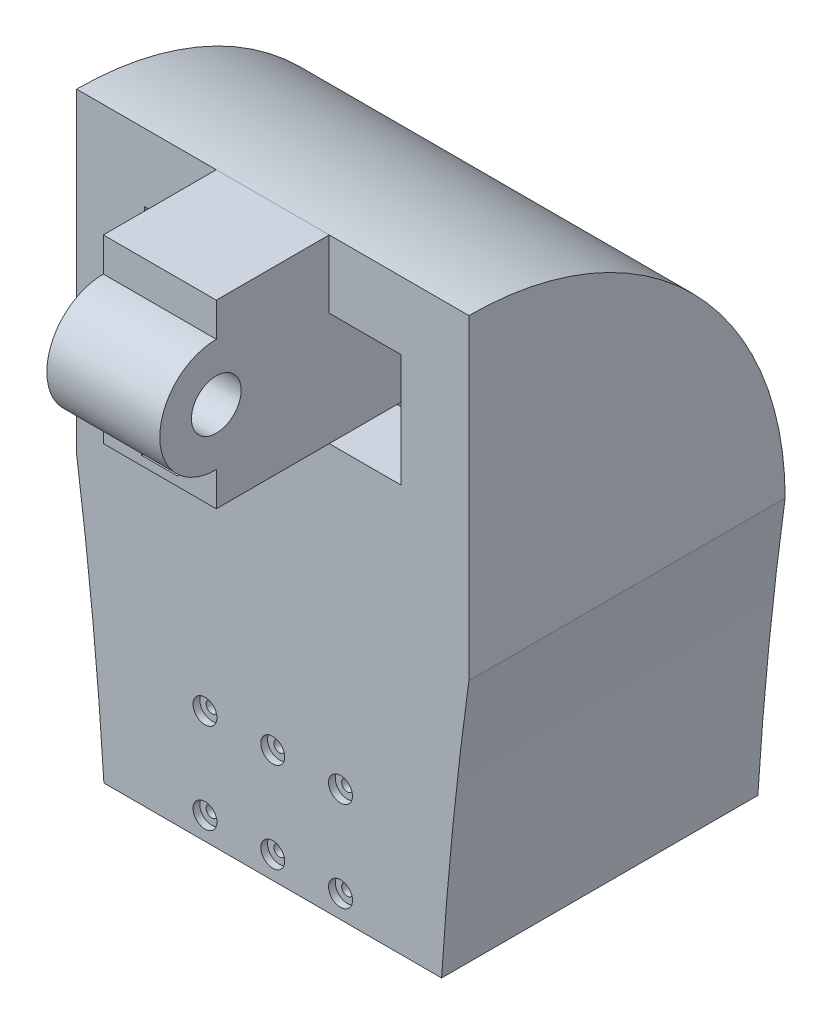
ISO-10303-21;
HEADER;
FILE_DESCRIPTION(('STEP AP214'),'2;1');
FILE_NAME('part.step','',(''),(''),'','','');
FILE_SCHEMA(('AUTOMOTIVE_DESIGN { 1 0 10303 214 1 1 1 1 }'));
ENDSEC;
DATA;
#1=APPLICATION_CONTEXT('core data for automotive mechanical design processes');
#2=APPLICATION_PROTOCOL_DEFINITION('international standard','automotive_design',2000,#1);
#3=PRODUCT_CONTEXT('',#1,'mechanical');
#4=PRODUCT('Part','Part','',(#3));
#5=PRODUCT_RELATED_PRODUCT_CATEGORY('part','',(#4));
#6=PRODUCT_DEFINITION_FORMATION('','',#4);
#7=PRODUCT_DEFINITION_CONTEXT('part definition',#1,'design');
#8=PRODUCT_DEFINITION('design','',#6,#7);
#9=PRODUCT_DEFINITION_SHAPE('','',#8);
#10=(LENGTH_UNIT() NAMED_UNIT(*) SI_UNIT(.MILLI.,.METRE.));
#11=(NAMED_UNIT(*) PLANE_ANGLE_UNIT() SI_UNIT($,.RADIAN.));
#12=(NAMED_UNIT(*) SI_UNIT($,.STERADIAN.) SOLID_ANGLE_UNIT());
#13=UNCERTAINTY_MEASURE_WITH_UNIT(LENGTH_MEASURE(1.E-05),#10,'distance_accuracy_value','');
#14=(GEOMETRIC_REPRESENTATION_CONTEXT(3) GLOBAL_UNCERTAINTY_ASSIGNED_CONTEXT((#13)) GLOBAL_UNIT_ASSIGNED_CONTEXT((#10,
#11,#12)) REPRESENTATION_CONTEXT('',''));
#15=CARTESIAN_POINT('',(0.,0.,0.));
#16=DIRECTION('',(0.,0.,1.));
#17=DIRECTION('',(1.,0.,0.));
#18=AXIS2_PLACEMENT_3D('',#15,#16,#17);
#19=CARTESIAN_POINT('',(114.999462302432,0.,140.));
#20=DIRECTION('',(0.,0.,1.));
#21=DIRECTION('',(1.,0.,0.));
#22=AXIS2_PLACEMENT_3D('',#19,#20,#21);
#23=PLANE('',#22);
#24=DIRECTION('',(0.,1.,0.));
#25=VECTOR('',#24,1.);
#26=CARTESIAN_POINT('',(94.9994623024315,0.,140.));
#27=LINE('',#26,#25);
#28=CARTESIAN_POINT('',(94.9994623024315,690.,140.));
#29=VERTEX_POINT('',#28);
#30=CARTESIAN_POINT('',(94.9994623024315,705.,140.));
#31=VERTEX_POINT('',#30);
#32=EDGE_CURVE('E440',#29,#31,#27,.T.);
#33=ORIENTED_EDGE('',*,*,#32,.T.);
#34=DIRECTION('',(-1.,0.,0.));
#35=VECTOR('',#34,1.);
#36=CARTESIAN_POINT('',(114.999462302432,705.,140.));
#37=LINE('',#36,#35);
#38=CARTESIAN_POINT('',(44.9994623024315,705.,140.));
#39=VERTEX_POINT('',#38);
#40=EDGE_CURVE('E432',#31,#39,#37,.T.);
#41=ORIENTED_EDGE('',*,*,#40,.T.);
#42=DIRECTION('',(0.,1.,0.));
#43=VECTOR('',#42,1.);
#44=CARTESIAN_POINT('',(44.9994623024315,0.,140.));
#45=LINE('',#44,#43);
#46=CARTESIAN_POINT('',(44.9994623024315,690.,140.));
#47=VERTEX_POINT('',#46);
#48=EDGE_CURVE('E426',#47,#39,#45,.T.);
#49=ORIENTED_EDGE('',*,*,#48,.F.);
#50=DIRECTION('',(-1.,0.,0.));
#51=VECTOR('',#50,1.);
#52=CARTESIAN_POINT('',(94.9994623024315,690.,140.));
#53=LINE('',#52,#51);
#54=EDGE_CURVE('E582',#29,#47,#53,.T.);
#55=ORIENTED_EDGE('',*,*,#54,.F.);
#56=EDGE_LOOP('',(#33,#41,#49,#55));
#57=FACE_BOUND('',#56,.T.);
#58=DIRECTION('',(0.,-1.,0.));
#59=VECTOR('',#58,1.);
#60=CARTESIAN_POINT('',(77.9994623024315,0.,140.));
#61=LINE('',#60,#59);
#62=CARTESIAN_POINT('',(77.9994623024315,701.,140.));
#63=VERTEX_POINT('',#62);
#64=CARTESIAN_POINT('',(77.9994623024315,694.,140.));
#65=VERTEX_POINT('',#64);
#66=EDGE_CURVE('E306',#63,#65,#61,.T.);
#67=ORIENTED_EDGE('',*,*,#66,.T.);
#68=DIRECTION('',(-1.,0.,0.));
#69=VECTOR('',#68,1.);
#70=CARTESIAN_POINT('',(0.,694.,140.));
#71=LINE('',#70,#69);
#72=CARTESIAN_POINT('',(61.9994623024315,694.,140.));
#73=VERTEX_POINT('',#72);
#74=EDGE_CURVE('E299',#65,#73,#71,.T.);
#75=ORIENTED_EDGE('',*,*,#74,.T.);
#76=DIRECTION('',(0.,1.,0.));
#77=VECTOR('',#76,1.);
#78=CARTESIAN_POINT('',(61.9994623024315,0.,140.));
#79=LINE('',#78,#77);
#80=CARTESIAN_POINT('',(61.9994623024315,701.,140.));
#81=VERTEX_POINT('',#80);
#82=EDGE_CURVE('E279',#73,#81,#79,.T.);
#83=ORIENTED_EDGE('',*,*,#82,.T.);
#84=DIRECTION('',(1.,0.,0.));
#85=VECTOR('',#84,1.);
#86=CARTESIAN_POINT('',(0.,701.,140.));
#87=LINE('',#86,#85);
#88=EDGE_CURVE('E307',#81,#63,#87,.T.);
#89=ORIENTED_EDGE('',*,*,#88,.T.);
#90=EDGE_LOOP('',(#67,#75,#83,#89));
#91=FACE_BOUND('',#90,.T.);
#92=ADVANCED_FACE('F54',(#57,#91),#23,.T.);
#93=CARTESIAN_POINT('',(100.,560.,180.));
#94=DIRECTION('',(0.,0.,-1.));
#95=DIRECTION('',(-1.,0.,0.));
#96=AXIS2_PLACEMENT_3D('',#93,#94,#95);
#97=CYLINDRICAL_SURFACE('',#96,2.5);
#98=CARTESIAN_POINT('',(100.,560.,70.));
#99=DIRECTION('',(0.,0.,-1.));
#100=DIRECTION('',(-1.,0.,0.));
#101=AXIS2_PLACEMENT_3D('',#98,#99,#100);
#102=CIRCLE('',#101,2.5);
#103=CARTESIAN_POINT('',(97.5000000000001,560.,70.));
#104=VERTEX_POINT('',#103);
#105=EDGE_CURVE('E489',#104,#104,#102,.T.);
#106=ORIENTED_EDGE('',*,*,#105,.T.);
#107=EDGE_LOOP('',(#106));
#108=FACE_BOUND('',#107,.T.);
#109=CARTESIAN_POINT('',(100.,560.,87.));
#110=DIRECTION('',(0.,0.,1.));
#111=DIRECTION('',(1.,0.,0.));
#112=AXIS2_PLACEMENT_3D('',#109,#110,#111);
#113=CIRCLE('',#112,2.5);
#114=CARTESIAN_POINT('',(102.5,560.,87.));
#115=VERTEX_POINT('',#114);
#116=EDGE_CURVE('E335',#115,#115,#113,.F.);
#117=ORIENTED_EDGE('',*,*,#116,.F.);
#118=EDGE_LOOP('',(#117));
#119=FACE_BOUND('',#118,.T.);
#120=ADVANCED_FACE('F768',(#108,#119),#97,.F.);
#121=CARTESIAN_POINT('',(39.9999999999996,520.000000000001,180.));
#122=DIRECTION('',(0.,0.,-1.));
#123=DIRECTION('',(-1.,0.,0.));
#124=AXIS2_PLACEMENT_3D('',#121,#122,#123);
#125=CYLINDRICAL_SURFACE('',#124,2.5);
#126=CARTESIAN_POINT('',(39.9999999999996,520.000000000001,70.));
#127=DIRECTION('',(0.,0.,-1.));
#128=DIRECTION('',(-1.,0.,0.));
#129=AXIS2_PLACEMENT_3D('',#126,#127,#128);
#130=CIRCLE('',#129,2.5);
#131=CARTESIAN_POINT('',(37.4999999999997,520.000000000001,70.));
#132=VERTEX_POINT('',#131);
#133=EDGE_CURVE('E506',#132,#132,#130,.T.);
#134=ORIENTED_EDGE('',*,*,#133,.T.);
#135=EDGE_LOOP('',(#134));
#136=FACE_BOUND('',#135,.T.);
#137=CARTESIAN_POINT('',(39.9999999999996,520.000000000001,87.));
#138=DIRECTION('',(0.,0.,1.));
#139=DIRECTION('',(1.,0.,0.));
#140=AXIS2_PLACEMENT_3D('',#137,#138,#139);
#141=CIRCLE('',#140,2.5);
#142=CARTESIAN_POINT('',(42.4999999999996,520.000000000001,87.));
#143=VERTEX_POINT('',#142);
#144=EDGE_CURVE('E360',#143,#143,#141,.F.);
#145=ORIENTED_EDGE('',*,*,#144,.F.);
#146=EDGE_LOOP('',(#145));
#147=FACE_BOUND('',#146,.T.);
#148=ADVANCED_FACE('F779',(#136,#147),#125,.F.);
#149=CARTESIAN_POINT('',(69.9999999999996,520.000000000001,180.));
#150=DIRECTION('',(0.,0.,-1.));
#151=DIRECTION('',(-1.,0.,0.));
#152=AXIS2_PLACEMENT_3D('',#149,#150,#151);
#153=CYLINDRICAL_SURFACE('',#152,2.5);
#154=CARTESIAN_POINT('',(69.9999999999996,520.000000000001,70.));
#155=DIRECTION('',(0.,0.,-1.));
#156=DIRECTION('',(-1.,0.,0.));
#157=AXIS2_PLACEMENT_3D('',#154,#155,#156);
#158=CIRCLE('',#157,2.5);
#159=CARTESIAN_POINT('',(67.4999999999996,520.000000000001,70.));
#160=VERTEX_POINT('',#159);
#161=EDGE_CURVE('E509',#160,#160,#158,.T.);
#162=ORIENTED_EDGE('',*,*,#161,.T.);
#163=EDGE_LOOP('',(#162));
#164=FACE_BOUND('',#163,.T.);
#165=CARTESIAN_POINT('',(69.9999999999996,520.000000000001,87.));
#166=DIRECTION('',(0.,0.,1.));
#167=DIRECTION('',(1.,0.,0.));
#168=AXIS2_PLACEMENT_3D('',#165,#166,#167);
#169=CIRCLE('',#168,2.5);
#170=CARTESIAN_POINT('',(72.4999999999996,520.000000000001,87.));
#171=VERTEX_POINT('',#170);
#172=EDGE_CURVE('E349',#171,#171,#169,.F.);
#173=ORIENTED_EDGE('',*,*,#172,.F.);
#174=EDGE_LOOP('',(#173));
#175=FACE_BOUND('',#174,.T.);
#176=ADVANCED_FACE('F939',(#164,#175),#153,.F.);
#177=CARTESIAN_POINT('',(99.9999999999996,520.,180.));
#178=DIRECTION('',(0.,0.,-1.));
#179=DIRECTION('',(-1.,0.,0.));
#180=AXIS2_PLACEMENT_3D('',#177,#178,#179);
#181=CYLINDRICAL_SURFACE('',#180,2.5);
#182=CARTESIAN_POINT('',(99.9999999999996,520.,70.));
#183=DIRECTION('',(0.,0.,-1.));
#184=DIRECTION('',(-1.,0.,0.));
#185=AXIS2_PLACEMENT_3D('',#182,#183,#184);
#186=CIRCLE('',#185,2.5);
#187=CARTESIAN_POINT('',(97.4999999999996,520.,70.));
#188=VERTEX_POINT('',#187);
#189=EDGE_CURVE('E511',#188,#188,#186,.T.);
#190=ORIENTED_EDGE('',*,*,#189,.T.);
#191=EDGE_LOOP('',(#190));
#192=FACE_BOUND('',#191,.T.);
#193=CARTESIAN_POINT('',(99.9999999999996,520.,87.));
#194=DIRECTION('',(0.,0.,1.));
#195=DIRECTION('',(1.,0.,0.));
#196=AXIS2_PLACEMENT_3D('',#193,#194,#195);
#197=CIRCLE('',#196,2.5);
#198=CARTESIAN_POINT('',(102.5,520.,87.));
#199=VERTEX_POINT('',#198);
#200=EDGE_CURVE('E343',#199,#199,#197,.F.);
#201=ORIENTED_EDGE('',*,*,#200,.F.);
#202=EDGE_LOOP('',(#201));
#203=FACE_BOUND('',#202,.T.);
#204=ADVANCED_FACE('F949',(#192,#203),#181,.F.);
#205=CARTESIAN_POINT('',(40.0000000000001,560.000000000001,180.));
#206=DIRECTION('',(0.,0.,-1.));
#207=DIRECTION('',(-1.,0.,0.));
#208=AXIS2_PLACEMENT_3D('',#205,#206,#207);
#209=CYLINDRICAL_SURFACE('',#208,2.5);
#210=CARTESIAN_POINT('',(40.0000000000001,560.000000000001,70.));
#211=DIRECTION('',(0.,0.,-1.));
#212=DIRECTION('',(-1.,0.,0.));
#213=AXIS2_PLACEMENT_3D('',#210,#211,#212);
#214=CIRCLE('',#213,2.5);
#215=CARTESIAN_POINT('',(37.5000000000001,560.000000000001,70.));
#216=VERTEX_POINT('',#215);
#217=EDGE_CURVE('E517',#216,#216,#214,.T.);
#218=ORIENTED_EDGE('',*,*,#217,.T.);
#219=EDGE_LOOP('',(#218));
#220=FACE_BOUND('',#219,.T.);
#221=CARTESIAN_POINT('',(40.0000000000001,560.000000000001,87.));
#222=DIRECTION('',(0.,0.,1.));
#223=DIRECTION('',(1.,0.,0.));
#224=AXIS2_PLACEMENT_3D('',#221,#222,#223);
#225=CIRCLE('',#224,2.5);
#226=CARTESIAN_POINT('',(42.5000000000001,560.000000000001,87.));
#227=VERTEX_POINT('',#226);
#228=EDGE_CURVE('E366',#227,#227,#225,.F.);
#229=ORIENTED_EDGE('',*,*,#228,.F.);
#230=EDGE_LOOP('',(#229));
#231=FACE_BOUND('',#230,.T.);
#232=ADVANCED_FACE('F944',(#220,#231),#209,.F.);
#233=CARTESIAN_POINT('',(70.0000000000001,560.000000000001,180.));
#234=DIRECTION('',(0.,0.,-1.));
#235=DIRECTION('',(-1.,0.,0.));
#236=AXIS2_PLACEMENT_3D('',#233,#234,#235);
#237=CYLINDRICAL_SURFACE('',#236,2.5);
#238=CARTESIAN_POINT('',(70.0000000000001,560.000000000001,70.));
#239=DIRECTION('',(0.,0.,-1.));
#240=DIRECTION('',(-1.,0.,0.));
#241=AXIS2_PLACEMENT_3D('',#238,#239,#240);
#242=CIRCLE('',#241,2.5);
#243=CARTESIAN_POINT('',(67.5000000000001,560.000000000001,70.));
#244=VERTEX_POINT('',#243);
#245=EDGE_CURVE('E525',#244,#244,#242,.T.);
#246=ORIENTED_EDGE('',*,*,#245,.T.);
#247=EDGE_LOOP('',(#246));
#248=FACE_BOUND('',#247,.T.);
#249=CARTESIAN_POINT('',(70.0000000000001,560.000000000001,87.));
#250=DIRECTION('',(0.,0.,1.));
#251=DIRECTION('',(1.,0.,0.));
#252=AXIS2_PLACEMENT_3D('',#249,#250,#251);
#253=CIRCLE('',#252,2.5);
#254=CARTESIAN_POINT('',(72.5000000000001,560.000000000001,87.));
#255=VERTEX_POINT('',#254);
#256=EDGE_CURVE('E323',#255,#255,#253,.F.);
#257=ORIENTED_EDGE('',*,*,#256,.F.);
#258=EDGE_LOOP('',(#257));
#259=FACE_BOUND('',#258,.T.);
#260=ADVANCED_FACE('F683',(#248,#259),#237,.F.);
#261=CARTESIAN_POINT('',(100.,560.,-30.));
#262=DIRECTION('',(0.,0.,1.));
#263=DIRECTION('',(1.,0.,0.));
#264=AXIS2_PLACEMENT_3D('',#261,#262,#263);
#265=CIRCLE('',#264,2.5);
#266=CARTESIAN_POINT('',(102.5,560.,-30.));
#267=VERTEX_POINT('',#266);
#268=EDGE_CURVE('E503',#267,#267,#265,.T.);
#269=ORIENTED_EDGE('',*,*,#268,.T.);
#270=EDGE_LOOP('',(#269));
#271=FACE_BOUND('',#270,.T.);
#272=CARTESIAN_POINT('',(100.,560.,-47.));
#273=DIRECTION('',(0.,0.,-1.));
#274=DIRECTION('',(-1.,0.,0.));
#275=AXIS2_PLACEMENT_3D('',#272,#273,#274);
#276=CIRCLE('',#275,2.5);
#277=CARTESIAN_POINT('',(97.5000000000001,560.,-47.));
#278=VERTEX_POINT('',#277);
#279=EDGE_CURVE('E56',#278,#278,#276,.F.);
#280=ORIENTED_EDGE('',*,*,#279,.F.);
#281=EDGE_LOOP('',(#280));
#282=FACE_BOUND('',#281,.T.);
#283=ADVANCED_FACE('F776',(#271,#282),#97,.F.);
#284=CARTESIAN_POINT('',(39.9999999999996,520.000000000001,-30.));
#285=DIRECTION('',(0.,0.,1.));
#286=DIRECTION('',(1.,0.,0.));
#287=AXIS2_PLACEMENT_3D('',#284,#285,#286);
#288=CIRCLE('',#287,2.5);
#289=CARTESIAN_POINT('',(42.4999999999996,520.000000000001,-30.));
#290=VERTEX_POINT('',#289);
#291=EDGE_CURVE('E510',#290,#290,#288,.T.);
#292=ORIENTED_EDGE('',*,*,#291,.T.);
#293=EDGE_LOOP('',(#292));
#294=FACE_BOUND('',#293,.T.);
#295=CARTESIAN_POINT('',(39.9999999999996,520.000000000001,-47.));
#296=DIRECTION('',(0.,0.,-1.));
#297=DIRECTION('',(-1.,0.,0.));
#298=AXIS2_PLACEMENT_3D('',#295,#296,#297);
#299=CIRCLE('',#298,2.5);
#300=CARTESIAN_POINT('',(37.4999999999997,520.000000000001,-47.));
#301=VERTEX_POINT('',#300);
#302=EDGE_CURVE('E387',#301,#301,#299,.F.);
#303=ORIENTED_EDGE('',*,*,#302,.F.);
#304=EDGE_LOOP('',(#303));
#305=FACE_BOUND('',#304,.T.);
#306=ADVANCED_FACE('F942',(#294,#305),#125,.F.);
#307=CARTESIAN_POINT('',(69.9999999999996,520.000000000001,-30.));
#308=DIRECTION('',(0.,0.,1.));
#309=DIRECTION('',(1.,0.,0.));
#310=AXIS2_PLACEMENT_3D('',#307,#308,#309);
#311=CIRCLE('',#310,2.5);
#312=CARTESIAN_POINT('',(72.4999999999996,520.000000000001,-30.));
#313=VERTEX_POINT('',#312);
#314=EDGE_CURVE('E512',#313,#313,#311,.T.);
#315=ORIENTED_EDGE('',*,*,#314,.T.);
#316=EDGE_LOOP('',(#315));
#317=FACE_BOUND('',#316,.T.);
#318=CARTESIAN_POINT('',(69.9999999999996,520.000000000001,-47.));
#319=DIRECTION('',(0.,0.,-1.));
#320=DIRECTION('',(-1.,0.,0.));
#321=AXIS2_PLACEMENT_3D('',#318,#319,#320);
#322=CIRCLE('',#321,2.5);
#323=CARTESIAN_POINT('',(67.4999999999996,520.000000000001,-47.));
#324=VERTEX_POINT('',#323);
#325=EDGE_CURVE('E378',#324,#324,#322,.F.);
#326=ORIENTED_EDGE('',*,*,#325,.F.);
#327=EDGE_LOOP('',(#326));
#328=FACE_BOUND('',#327,.T.);
#329=ADVANCED_FACE('F958',(#317,#328),#153,.F.);
#330=CARTESIAN_POINT('',(99.9999999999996,520.,-30.));
#331=DIRECTION('',(0.,0.,1.));
#332=DIRECTION('',(1.,0.,0.));
#333=AXIS2_PLACEMENT_3D('',#330,#331,#332);
#334=CIRCLE('',#333,2.5);
#335=CARTESIAN_POINT('',(102.5,520.,-30.));
#336=VERTEX_POINT('',#335);
#337=EDGE_CURVE('E513',#336,#336,#334,.T.);
#338=ORIENTED_EDGE('',*,*,#337,.T.);
#339=EDGE_LOOP('',(#338));
#340=FACE_BOUND('',#339,.T.);
#341=CARTESIAN_POINT('',(99.9999999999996,520.,-47.));
#342=DIRECTION('',(0.,0.,-1.));
#343=DIRECTION('',(-1.,0.,0.));
#344=AXIS2_PLACEMENT_3D('',#341,#342,#343);
#345=CIRCLE('',#344,2.5);
#346=CARTESIAN_POINT('',(97.4999999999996,520.,-47.));
#347=VERTEX_POINT('',#346);
#348=EDGE_CURVE('E420',#347,#347,#345,.F.);
#349=ORIENTED_EDGE('',*,*,#348,.F.);
#350=EDGE_LOOP('',(#349));
#351=FACE_BOUND('',#350,.T.);
#352=ADVANCED_FACE('F954',(#340,#351),#181,.F.);
#353=CARTESIAN_POINT('',(40.0000000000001,560.000000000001,-30.));
#354=DIRECTION('',(0.,0.,1.));
#355=DIRECTION('',(1.,0.,0.));
#356=AXIS2_PLACEMENT_3D('',#353,#354,#355);
#357=CIRCLE('',#356,2.5);
#358=CARTESIAN_POINT('',(42.5000000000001,560.000000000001,-30.));
#359=VERTEX_POINT('',#358);
#360=EDGE_CURVE('E520',#359,#359,#357,.T.);
#361=ORIENTED_EDGE('',*,*,#360,.T.);
#362=EDGE_LOOP('',(#361));
#363=FACE_BOUND('',#362,.T.);
#364=CARTESIAN_POINT('',(40.0000000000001,560.000000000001,-47.));
#365=DIRECTION('',(0.,0.,-1.));
#366=DIRECTION('',(-1.,0.,0.));
#367=AXIS2_PLACEMENT_3D('',#364,#365,#366);
#368=CIRCLE('',#367,2.5);
#369=CARTESIAN_POINT('',(37.5000000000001,560.000000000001,-47.));
#370=VERTEX_POINT('',#369);
#371=EDGE_CURVE('E400',#370,#370,#368,.F.);
#372=ORIENTED_EDGE('',*,*,#371,.F.);
#373=EDGE_LOOP('',(#372));
#374=FACE_BOUND('',#373,.T.);
#375=ADVANCED_FACE('F951',(#363,#374),#209,.F.);
#376=CARTESIAN_POINT('',(70.0000000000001,560.000000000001,-30.));
#377=DIRECTION('',(0.,0.,1.));
#378=DIRECTION('',(1.,0.,0.));
#379=AXIS2_PLACEMENT_3D('',#376,#377,#378);
#380=CIRCLE('',#379,2.5);
#381=CARTESIAN_POINT('',(72.5000000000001,560.000000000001,-30.));
#382=VERTEX_POINT('',#381);
#383=EDGE_CURVE('E523',#382,#382,#380,.T.);
#384=ORIENTED_EDGE('',*,*,#383,.T.);
#385=EDGE_LOOP('',(#384));
#386=FACE_BOUND('',#385,.T.);
#387=CARTESIAN_POINT('',(70.0000000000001,560.000000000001,-47.));
#388=DIRECTION('',(0.,0.,-1.));
#389=DIRECTION('',(-1.,0.,0.));
#390=AXIS2_PLACEMENT_3D('',#387,#388,#389);
#391=CIRCLE('',#390,2.5);
#392=CARTESIAN_POINT('',(67.5000000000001,560.000000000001,-47.));
#393=VERTEX_POINT('',#392);
#394=EDGE_CURVE('E408',#393,#393,#391,.F.);
#395=ORIENTED_EDGE('',*,*,#394,.F.);
#396=EDGE_LOOP('',(#395));
#397=FACE_BOUND('',#396,.T.);
#398=ADVANCED_FACE('F948',(#386,#397),#237,.F.);
#399=CARTESIAN_POINT('',(1711.62336455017,410.,-30.));
#400=DIRECTION('',(0.,0.,1.));
#401=DIRECTION('',(1.,0.,0.));
#402=AXIS2_PLACEMENT_3D('',#399,#400,#401);
#403=PLANE('',#402);
#404=ORIENTED_EDGE('',*,*,#383,.F.);
#405=EDGE_LOOP('',(#404));
#406=FACE_BOUND('',#405,.T.);
#407=ORIENTED_EDGE('',*,*,#360,.F.);
#408=EDGE_LOOP('',(#407));
#409=FACE_BOUND('',#408,.T.);
#410=ORIENTED_EDGE('',*,*,#337,.F.);
#411=EDGE_LOOP('',(#410));
#412=FACE_BOUND('',#411,.T.);
#413=ORIENTED_EDGE('',*,*,#314,.F.);
#414=EDGE_LOOP('',(#413));
#415=FACE_BOUND('',#414,.T.);
#416=ORIENTED_EDGE('',*,*,#291,.F.);
#417=EDGE_LOOP('',(#416));
#418=FACE_BOUND('',#417,.T.);
#419=ORIENTED_EDGE('',*,*,#268,.F.);
#420=EDGE_LOOP('',(#419));
#421=FACE_BOUND('',#420,.T.);
#422=DIRECTION('',(1.,0.,0.));
#423=VECTOR('',#422,1.);
#424=CARTESIAN_POINT('',(-3.18676198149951E-12,570.113759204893,-30.));
#425=LINE('',#424,#423);
#426=CARTESIAN_POINT('',(25.2485777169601,570.113759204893,-30.));
#427=VERTEX_POINT('',#426);
#428=CARTESIAN_POINT('',(114.75142228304,570.113759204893,-30.));
#429=VERTEX_POINT('',#428);
#430=EDGE_CURVE('E465',#427,#429,#425,.T.);
#431=ORIENTED_EDGE('',*,*,#430,.F.);
#432=DIRECTION('',(0.,1.,0.));
#433=VECTOR('',#432,1.);
#434=CARTESIAN_POINT('',(25.248577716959,0.,-30.));
#435=LINE('',#434,#433);
#436=CARTESIAN_POINT('',(25.2485777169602,510.,-30.));
#437=VERTEX_POINT('',#436);
#438=EDGE_CURVE('E447',#437,#427,#435,.T.);
#439=ORIENTED_EDGE('',*,*,#438,.F.);
#440=DIRECTION('',(1.,0.,0.));
#441=VECTOR('',#440,1.);
#442=CARTESIAN_POINT('',(1711.62336455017,510.,-30.));
#443=LINE('',#442,#441);
#444=CARTESIAN_POINT('',(114.75142228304,510.,-30.));
#445=VERTEX_POINT('',#444);
#446=EDGE_CURVE('E540',#437,#445,#443,.T.);
#447=ORIENTED_EDGE('',*,*,#446,.T.);
#448=DIRECTION('',(0.,1.,0.));
#449=VECTOR('',#448,1.);
#450=CARTESIAN_POINT('',(114.751422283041,2.12332785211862E-13,-30.));
#451=LINE('',#450,#449);
#452=EDGE_CURVE('E453',#445,#429,#451,.T.);
#453=ORIENTED_EDGE('',*,*,#452,.T.);
#454=EDGE_LOOP('',(#431,#439,#447,#453));
#455=FACE_BOUND('',#454,.T.);
#456=ADVANCED_FACE('F686',(#406,#409,#412,#415,#418,#421,#455),#403,.T.);
#457=CARTESIAN_POINT('',(1711.62336455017,410.,70.));
#458=DIRECTION('',(0.,0.,-1.));
#459=DIRECTION('',(-1.,0.,0.));
#460=AXIS2_PLACEMENT_3D('',#457,#458,#459);
#461=PLANE('',#460);
#462=ORIENTED_EDGE('',*,*,#245,.F.);
#463=EDGE_LOOP('',(#462));
#464=FACE_BOUND('',#463,.T.);
#465=ORIENTED_EDGE('',*,*,#217,.F.);
#466=EDGE_LOOP('',(#465));
#467=FACE_BOUND('',#466,.T.);
#468=ORIENTED_EDGE('',*,*,#189,.F.);
#469=EDGE_LOOP('',(#468));
#470=FACE_BOUND('',#469,.T.);
#471=ORIENTED_EDGE('',*,*,#161,.F.);
#472=EDGE_LOOP('',(#471));
#473=FACE_BOUND('',#472,.T.);
#474=ORIENTED_EDGE('',*,*,#133,.F.);
#475=EDGE_LOOP('',(#474));
#476=FACE_BOUND('',#475,.T.);
#477=ORIENTED_EDGE('',*,*,#105,.F.);
#478=EDGE_LOOP('',(#477));
#479=FACE_BOUND('',#478,.T.);
#480=DIRECTION('',(0.,1.,0.));
#481=VECTOR('',#480,1.);
#482=CARTESIAN_POINT('',(25.248577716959,0.,70.));
#483=LINE('',#482,#481);
#484=CARTESIAN_POINT('',(25.2485777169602,510.,70.));
#485=VERTEX_POINT('',#484);
#486=CARTESIAN_POINT('',(25.2485777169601,570.,70.));
#487=VERTEX_POINT('',#486);
#488=EDGE_CURVE('E483',#485,#487,#483,.T.);
#489=ORIENTED_EDGE('',*,*,#488,.T.);
#490=DIRECTION('',(-1.,0.,0.));
#491=VECTOR('',#490,1.);
#492=CARTESIAN_POINT('',(-7.07046940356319E-13,570.,70.));
#493=LINE('',#492,#491);
#494=CARTESIAN_POINT('',(114.75142228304,570.,70.));
#495=VERTEX_POINT('',#494);
#496=EDGE_CURVE('E475',#495,#487,#493,.T.);
#497=ORIENTED_EDGE('',*,*,#496,.F.);
#498=DIRECTION('',(0.,1.,0.));
#499=VECTOR('',#498,1.);
#500=CARTESIAN_POINT('',(114.751422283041,2.12332785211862E-13,70.));
#501=LINE('',#500,#499);
#502=CARTESIAN_POINT('',(114.75142228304,510.,70.));
#503=VERTEX_POINT('',#502);
#504=EDGE_CURVE('E487',#503,#495,#501,.T.);
#505=ORIENTED_EDGE('',*,*,#504,.F.);
#506=DIRECTION('',(-1.,0.,0.));
#507=VECTOR('',#506,1.);
#508=CARTESIAN_POINT('',(1711.62336455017,510.,70.));
#509=LINE('',#508,#507);
#510=EDGE_CURVE('E12',#503,#485,#509,.T.);
#511=ORIENTED_EDGE('',*,*,#510,.T.);
#512=EDGE_LOOP('',(#489,#497,#505,#511));
#513=FACE_BOUND('',#512,.T.);
#514=ADVANCED_FACE('F685',(#464,#467,#470,#473,#476,#479,#513),#461,.T.);
#515=CARTESIAN_POINT('',(25.248577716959,0.,60.));
#516=DIRECTION('',(1.,0.,0.));
#517=DIRECTION('',(0.,1.,0.));
#518=AXIS2_PLACEMENT_3D('',#515,#516,#517);
#519=PLANE('',#518);
#520=DIRECTION('',(0.,1.,0.));
#521=VECTOR('',#520,1.);
#522=CARTESIAN_POINT('',(25.248577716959,0.,60.));
#523=LINE('',#522,#521);
#524=CARTESIAN_POINT('',(25.2485777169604,510.,60.));
#525=VERTEX_POINT('',#524);
#526=CARTESIAN_POINT('',(25.2485777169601,570.,60.));
#527=VERTEX_POINT('',#526);
#528=EDGE_CURVE('E494',#525,#527,#523,.T.);
#529=ORIENTED_EDGE('',*,*,#528,.T.);
#530=DIRECTION('',(0.,0.,1.));
#531=VECTOR('',#530,1.);
#532=CARTESIAN_POINT('',(25.2485777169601,570.,60.));
#533=LINE('',#532,#531);
#534=EDGE_CURVE('E480',#527,#487,#533,.T.);
#535=ORIENTED_EDGE('',*,*,#534,.T.);
#536=ORIENTED_EDGE('',*,*,#488,.F.);
#537=DIRECTION('',(0.,0.,1.));
#538=VECTOR('',#537,1.);
#539=CARTESIAN_POINT('',(25.2485777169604,510.,60.));
#540=LINE('',#539,#538);
#541=EDGE_CURVE('E491',#525,#485,#540,.T.);
#542=ORIENTED_EDGE('',*,*,#541,.F.);
#543=EDGE_LOOP('',(#529,#535,#536,#542));
#544=FACE_BOUND('',#543,.T.);
#545=ADVANCED_FACE('F690',(#544),#519,.T.);
#546=CARTESIAN_POINT('',(114.751422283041,2.12332785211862E-13,60.));
#547=DIRECTION('',(1.,0.,0.));
#548=DIRECTION('',(0.,1.,0.));
#549=AXIS2_PLACEMENT_3D('',#546,#547,#548);
#550=PLANE('',#549);
#551=DIRECTION('',(0.,0.,1.));
#552=VECTOR('',#551,1.);
#553=CARTESIAN_POINT('',(114.75142228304,570.,60.));
#554=LINE('',#553,#552);
#555=CARTESIAN_POINT('',(114.75142228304,570.,60.));
#556=VERTEX_POINT('',#555);
#557=EDGE_CURVE('E481',#556,#495,#554,.T.);
#558=ORIENTED_EDGE('',*,*,#557,.F.);
#559=DIRECTION('',(0.,1.,0.));
#560=VECTOR('',#559,1.);
#561=CARTESIAN_POINT('',(114.751422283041,2.12332785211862E-13,60.));
#562=LINE('',#561,#560);
#563=CARTESIAN_POINT('',(114.75142228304,510.,60.));
#564=VERTEX_POINT('',#563);
#565=EDGE_CURVE('E488',#564,#556,#562,.T.);
#566=ORIENTED_EDGE('',*,*,#565,.F.);
#567=DIRECTION('',(0.,0.,-1.));
#568=VECTOR('',#567,1.);
#569=CARTESIAN_POINT('',(114.75142228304,510.,80.));
#570=LINE('',#569,#568);
#571=EDGE_CURVE('E538',#503,#564,#570,.T.);
#572=ORIENTED_EDGE('',*,*,#571,.F.);
#573=ORIENTED_EDGE('',*,*,#504,.T.);
#574=EDGE_LOOP('',(#558,#566,#572,#573));
#575=FACE_BOUND('',#574,.T.);
#576=ADVANCED_FACE('F753',(#575),#550,.F.);
#577=CARTESIAN_POINT('',(1711.62336455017,410.,80.));
#578=DIRECTION('',(0.,0.,-1.));
#579=DIRECTION('',(-1.,0.,0.));
#580=AXIS2_PLACEMENT_3D('',#577,#578,#579);
#581=CYLINDRICAL_SURFACE('',#580,1600.);
#582=DIRECTION('',(0.,0.,-1.));
#583=VECTOR('',#582,1.);
#584=CARTESIAN_POINT('',(126.820537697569,630.,80.));
#585=LINE('',#584,#583);
#586=CARTESIAN_POINT('',(126.820537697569,630.,60.));
#587=VERTEX_POINT('',#586);
#588=CARTESIAN_POINT('',(126.820537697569,630.,-20.));
#589=VERTEX_POINT('',#588);
#590=EDGE_CURVE('E652',#587,#589,#585,.T.);
#591=ORIENTED_EDGE('',*,*,#590,.T.);
#592=CARTESIAN_POINT('',(1711.62336455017,410.,-20.));
#593=DIRECTION('',(0.,0.,1.));
#594=DIRECTION('',(1.,0.,0.));
#595=AXIS2_PLACEMENT_3D('',#592,#593,#594);
#596=CIRCLE('',#595,1600.);
#597=CARTESIAN_POINT('',(114.75142228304,510.,-20.));
#598=VERTEX_POINT('',#597);
#599=EDGE_CURVE('E458',#598,#589,#596,.F.);
#600=ORIENTED_EDGE('',*,*,#599,.F.);
#601=EDGE_CURVE('E533',#564,#598,#570,.T.);
#602=ORIENTED_EDGE('',*,*,#601,.F.);
#603=CARTESIAN_POINT('',(1711.62336455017,410.,60.));
#604=DIRECTION('',(0.,0.,-1.));
#605=DIRECTION('',(-1.,0.,0.));
#606=AXIS2_PLACEMENT_3D('',#603,#604,#605);
#607=CIRCLE('',#606,1600.);
#608=EDGE_CURVE('E482',#587,#564,#607,.F.);
#609=ORIENTED_EDGE('',*,*,#608,.F.);
#610=EDGE_LOOP('',(#591,#600,#602,#609));
#611=FACE_BOUND('',#610,.T.);
#612=ADVANCED_FACE('F744',(#611),#581,.T.);
#613=CARTESIAN_POINT('',(-1571.62336455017,410.,90.));
#614=DIRECTION('',(0.,0.,-1.));
#615=DIRECTION('',(-1.,0.,0.));
#616=AXIS2_PLACEMENT_3D('',#613,#614,#615);
#617=CYLINDRICAL_SURFACE('',#616,1600.);
#618=DIRECTION('',(0.,0.,-1.));
#619=VECTOR('',#618,1.);
#620=CARTESIAN_POINT('',(25.2485777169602,510.,90.));
#621=LINE('',#620,#619);
#622=CARTESIAN_POINT('',(25.2485777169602,510.,-20.));
#623=VERTEX_POINT('',#622);
#624=EDGE_CURVE('E529',#623,#525,#621,.F.);
#625=ORIENTED_EDGE('',*,*,#624,.F.);
#626=CARTESIAN_POINT('',(-1571.62336455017,410.,-20.));
#627=DIRECTION('',(0.,0.,1.));
#628=DIRECTION('',(1.,0.,0.));
#629=AXIS2_PLACEMENT_3D('',#626,#627,#628);
#630=CIRCLE('',#629,1600.);
#631=CARTESIAN_POINT('',(13.1794623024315,630.,-20.));
#632=VERTEX_POINT('',#631);
#633=EDGE_CURVE('E450',#632,#623,#630,.F.);
#634=ORIENTED_EDGE('',*,*,#633,.F.);
#635=DIRECTION('',(0.,0.,1.));
#636=VECTOR('',#635,1.);
#637=CARTESIAN_POINT('',(13.1794623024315,630.,90.));
#638=LINE('',#637,#636);
#639=CARTESIAN_POINT('',(13.1794623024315,630.,60.));
#640=VERTEX_POINT('',#639);
#641=EDGE_CURVE('E605',#632,#640,#638,.T.);
#642=ORIENTED_EDGE('',*,*,#641,.T.);
#643=CARTESIAN_POINT('',(-1571.62336455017,410.,60.));
#644=DIRECTION('',(0.,0.,-1.));
#645=DIRECTION('',(-1.,0.,0.));
#646=AXIS2_PLACEMENT_3D('',#643,#644,#645);
#647=CIRCLE('',#646,1600.);
#648=EDGE_CURVE('E500',#525,#640,#647,.F.);
#649=ORIENTED_EDGE('',*,*,#648,.F.);
#650=EDGE_LOOP('',(#625,#634,#642,#649));
#651=FACE_BOUND('',#650,.T.);
#652=ADVANCED_FACE('F711',(#651),#617,.T.);
#653=CARTESIAN_POINT('',(1741.62336455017,410.,80.));
#654=DIRECTION('',(0.,0.,-1.));
#655=DIRECTION('',(-1.,0.,0.));
#656=AXIS2_PLACEMENT_3D('',#653,#654,#655);
#657=CYLINDRICAL_SURFACE('',#656,1600.);
#658=CARTESIAN_POINT('',(1741.62336455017,410.,90.));
#659=DIRECTION('',(0.,0.,-1.));
#660=DIRECTION('',(1.,0.,0.));
#661=AXIS2_PLACEMENT_3D('',#658,#659,#660);
#662=CIRCLE('',#661,1600.);
#663=CARTESIAN_POINT('',(144.75142228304,510.,89.9999999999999));
#664=VERTEX_POINT('',#663);
#665=CARTESIAN_POINT('',(156.820537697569,630.,90.));
#666=VERTEX_POINT('',#665);
#667=EDGE_CURVE('E660',#664,#666,#662,.T.);
#668=ORIENTED_EDGE('',*,*,#667,.F.);
#669=DIRECTION('',(0.,0.,-1.));
#670=VECTOR('',#669,1.);
#671=CARTESIAN_POINT('',(144.75142228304,510.,80.));
#672=LINE('',#671,#670);
#673=CARTESIAN_POINT('',(144.75142228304,510.,-50.));
#674=VERTEX_POINT('',#673);
#675=EDGE_CURVE('E542',#664,#674,#672,.T.);
#676=ORIENTED_EDGE('',*,*,#675,.T.);
#677=CARTESIAN_POINT('',(1741.62336455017,410.,-50.));
#678=DIRECTION('',(0.,0.,-1.));
#679=DIRECTION('',(-1.,0.,0.));
#680=AXIS2_PLACEMENT_3D('',#677,#678,#679);
#681=CIRCLE('',#680,1600.);
#682=CARTESIAN_POINT('',(156.820537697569,630.,-50.0000000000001));
#683=VERTEX_POINT('',#682);
#684=EDGE_CURVE('E657',#683,#674,#681,.F.);
#685=ORIENTED_EDGE('',*,*,#684,.F.);
#686=DIRECTION('',(0.,0.,-1.));
#687=VECTOR('',#686,1.);
#688=CARTESIAN_POINT('',(156.820537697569,630.,80.));
#689=LINE('',#688,#687);
#690=EDGE_CURVE('E655',#666,#683,#689,.T.);
#691=ORIENTED_EDGE('',*,*,#690,.F.);
#692=EDGE_LOOP('',(#668,#676,#685,#691));
#693=FACE_BOUND('',#692,.T.);
#694=ADVANCED_FACE('F897',(#693),#657,.F.);
#695=CARTESIAN_POINT('',(0.,0.,-50.));
#696=DIRECTION('',(0.,0.,-1.));
#697=DIRECTION('',(-1.,0.,0.));
#698=AXIS2_PLACEMENT_3D('',#695,#696,#697);
#699=PLANE('',#698);
#700=CARTESIAN_POINT('',(100.,560.,-50.));
#701=DIRECTION('',(0.,0.,-1.));
#702=DIRECTION('',(-1.,0.,0.));
#703=AXIS2_PLACEMENT_3D('',#700,#701,#702);
#704=CIRCLE('',#703,5.30000000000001);
#705=CARTESIAN_POINT('',(94.7,560.,-50.));
#706=VERTEX_POINT('',#705);
#707=EDGE_CURVE('E406',#706,#706,#704,.T.);
#708=ORIENTED_EDGE('',*,*,#707,.F.);
#709=EDGE_LOOP('',(#708));
#710=FACE_BOUND('',#709,.T.);
#711=CARTESIAN_POINT('',(70.0000000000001,560.000000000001,-50.));
#712=DIRECTION('',(0.,0.,-1.));
#713=DIRECTION('',(-1.,0.,0.));
#714=AXIS2_PLACEMENT_3D('',#711,#712,#713);
#715=CIRCLE('',#714,5.30000000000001);
#716=CARTESIAN_POINT('',(64.7,560.000000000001,-50.));
#717=VERTEX_POINT('',#716);
#718=EDGE_CURVE('E402',#717,#717,#715,.T.);
#719=ORIENTED_EDGE('',*,*,#718,.F.);
#720=EDGE_LOOP('',(#719));
#721=FACE_BOUND('',#720,.T.);
#722=CARTESIAN_POINT('',(40.0000000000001,560.000000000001,-50.));
#723=DIRECTION('',(0.,0.,-1.));
#724=DIRECTION('',(-1.,0.,0.));
#725=AXIS2_PLACEMENT_3D('',#722,#723,#724);
#726=CIRCLE('',#725,5.30000000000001);
#727=CARTESIAN_POINT('',(34.7000000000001,560.000000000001,-50.));
#728=VERTEX_POINT('',#727);
#729=EDGE_CURVE('E395',#728,#728,#726,.T.);
#730=ORIENTED_EDGE('',*,*,#729,.F.);
#731=EDGE_LOOP('',(#730));
#732=FACE_BOUND('',#731,.T.);
#733=CARTESIAN_POINT('',(39.9999999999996,520.000000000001,-50.));
#734=DIRECTION('',(0.,0.,-1.));
#735=DIRECTION('',(-1.,0.,0.));
#736=AXIS2_PLACEMENT_3D('',#733,#734,#735);
#737=CIRCLE('',#736,5.30000000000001);
#738=CARTESIAN_POINT('',(34.6999999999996,520.000000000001,-50.));
#739=VERTEX_POINT('',#738);
#740=EDGE_CURVE('E384',#739,#739,#737,.T.);
#741=ORIENTED_EDGE('',*,*,#740,.F.);
#742=EDGE_LOOP('',(#741));
#743=FACE_BOUND('',#742,.T.);
#744=CARTESIAN_POINT('',(69.9999999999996,520.000000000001,-50.));
#745=DIRECTION('',(0.,0.,-1.));
#746=DIRECTION('',(-1.,0.,0.));
#747=AXIS2_PLACEMENT_3D('',#744,#745,#746);
#748=CIRCLE('',#747,5.30000000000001);
#749=CARTESIAN_POINT('',(64.6999999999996,520.000000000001,-50.));
#750=VERTEX_POINT('',#749);
#751=EDGE_CURVE('E374',#750,#750,#748,.T.);
#752=ORIENTED_EDGE('',*,*,#751,.F.);
#753=EDGE_LOOP('',(#752));
#754=FACE_BOUND('',#753,.T.);
#755=CARTESIAN_POINT('',(99.9999999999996,520.,-50.));
#756=DIRECTION('',(0.,0.,-1.));
#757=DIRECTION('',(-1.,0.,0.));
#758=AXIS2_PLACEMENT_3D('',#755,#756,#757);
#759=CIRCLE('',#758,5.30000000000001);
#760=CARTESIAN_POINT('',(94.6999999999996,520.,-50.));
#761=VERTEX_POINT('',#760);
#762=EDGE_CURVE('E377',#761,#761,#759,.T.);
#763=ORIENTED_EDGE('',*,*,#762,.F.);
#764=EDGE_LOOP('',(#763));
#765=FACE_BOUND('',#764,.T.);
#766=ORIENTED_EDGE('',*,*,#684,.T.);
#767=DIRECTION('',(-1.,0.,0.));
#768=VECTOR('',#767,1.);
#769=CARTESIAN_POINT('',(153.179462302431,510.,-50.));
#770=LINE('',#769,#768);
#771=CARTESIAN_POINT('',(-4.75142228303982,510.,-50.));
#772=VERTEX_POINT('',#771);
#773=EDGE_CURVE('E530',#674,#772,#770,.T.);
#774=ORIENTED_EDGE('',*,*,#773,.T.);
#775=CARTESIAN_POINT('',(-1601.62336455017,410.,-50.));
#776=DIRECTION('',(0.,0.,-1.));
#777=DIRECTION('',(-1.,0.,0.));
#778=AXIS2_PLACEMENT_3D('',#775,#776,#777);
#779=CIRCLE('',#778,1600.);
#780=CARTESIAN_POINT('',(-16.8205376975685,630.,-50.));
#781=VERTEX_POINT('',#780);
#782=EDGE_CURVE('E629',#781,#772,#779,.T.);
#783=ORIENTED_EDGE('',*,*,#782,.F.);
#784=DIRECTION('',(1.,0.,0.));
#785=VECTOR('',#784,1.);
#786=CARTESIAN_POINT('',(0.,630.,-50.));
#787=LINE('',#786,#785);
#788=EDGE_CURVE('E650',#781,#683,#787,.T.);
#789=ORIENTED_EDGE('',*,*,#788,.T.);
#790=EDGE_LOOP('',(#766,#774,#783,#789));
#791=FACE_BOUND('',#790,.T.);
#792=ADVANCED_FACE('F896',(#710,#721,#732,#743,#754,#765,#791),#699,.T.);
#793=CARTESIAN_POINT('',(0.,0.,90.));
#794=DIRECTION('',(0.,0.,1.));
#795=DIRECTION('',(1.,0.,0.));
#796=AXIS2_PLACEMENT_3D('',#793,#794,#795);
#797=PLANE('',#796);
#798=CARTESIAN_POINT('',(39.9999999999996,520.000000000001,90.));
#799=DIRECTION('',(0.,0.,1.));
#800=DIRECTION('',(1.,0.,0.));
#801=AXIS2_PLACEMENT_3D('',#798,#799,#800);
#802=CIRCLE('',#801,5.30000000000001);
#803=CARTESIAN_POINT('',(45.2999999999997,520.000000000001,90.));
#804=VERTEX_POINT('',#803);
#805=EDGE_CURVE('E317',#804,#804,#802,.T.);
#806=ORIENTED_EDGE('',*,*,#805,.F.);
#807=EDGE_LOOP('',(#806));
#808=FACE_BOUND('',#807,.T.);
#809=CARTESIAN_POINT('',(69.9999999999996,520.000000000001,90.));
#810=DIRECTION('',(0.,0.,1.));
#811=DIRECTION('',(1.,0.,0.));
#812=AXIS2_PLACEMENT_3D('',#809,#810,#811);
#813=CIRCLE('',#812,5.30000000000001);
#814=CARTESIAN_POINT('',(75.2999999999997,520.000000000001,90.));
#815=VERTEX_POINT('',#814);
#816=EDGE_CURVE('E353',#815,#815,#813,.T.);
#817=ORIENTED_EDGE('',*,*,#816,.F.);
#818=EDGE_LOOP('',(#817));
#819=FACE_BOUND('',#818,.T.);
#820=CARTESIAN_POINT('',(99.9999999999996,520.,90.));
#821=DIRECTION('',(0.,0.,1.));
#822=DIRECTION('',(1.,0.,0.));
#823=AXIS2_PLACEMENT_3D('',#820,#821,#822);
#824=CIRCLE('',#823,5.30000000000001);
#825=CARTESIAN_POINT('',(105.3,520.,90.));
#826=VERTEX_POINT('',#825);
#827=EDGE_CURVE('E345',#826,#826,#824,.T.);
#828=ORIENTED_EDGE('',*,*,#827,.F.);
#829=EDGE_LOOP('',(#828));
#830=FACE_BOUND('',#829,.T.);
#831=CARTESIAN_POINT('',(100.,560.,90.));
#832=DIRECTION('',(0.,0.,1.));
#833=DIRECTION('',(1.,0.,0.));
#834=AXIS2_PLACEMENT_3D('',#831,#832,#833);
#835=CIRCLE('',#834,5.30000000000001);
#836=CARTESIAN_POINT('',(105.3,560.,90.));
#837=VERTEX_POINT('',#836);
#838=EDGE_CURVE('E334',#837,#837,#835,.T.);
#839=ORIENTED_EDGE('',*,*,#838,.F.);
#840=EDGE_LOOP('',(#839));
#841=FACE_BOUND('',#840,.T.);
#842=CARTESIAN_POINT('',(70.0000000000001,560.000000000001,90.));
#843=DIRECTION('',(0.,0.,1.));
#844=DIRECTION('',(1.,0.,0.));
#845=AXIS2_PLACEMENT_3D('',#842,#843,#844);
#846=CIRCLE('',#845,5.30000000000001);
#847=CARTESIAN_POINT('',(75.3000000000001,560.000000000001,90.));
#848=VERTEX_POINT('',#847);
#849=EDGE_CURVE('E321',#848,#848,#846,.T.);
#850=ORIENTED_EDGE('',*,*,#849,.F.);
#851=EDGE_LOOP('',(#850));
#852=FACE_BOUND('',#851,.T.);
#853=CARTESIAN_POINT('',(40.0000000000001,560.000000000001,90.));
#854=DIRECTION('',(0.,0.,1.));
#855=DIRECTION('',(1.,0.,0.));
#856=AXIS2_PLACEMENT_3D('',#853,#854,#855);
#857=CIRCLE('',#856,5.30000000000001);
#858=CARTESIAN_POINT('',(45.3000000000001,560.000000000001,90.));
#859=VERTEX_POINT('',#858);
#860=EDGE_CURVE('E328',#859,#859,#857,.T.);
#861=ORIENTED_EDGE('',*,*,#860,.F.);
#862=EDGE_LOOP('',(#861));
#863=FACE_BOUND('',#862,.T.);
#864=CARTESIAN_POINT('',(-1601.62336455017,410.,90.));
#865=DIRECTION('',(0.,0.,-1.));
#866=DIRECTION('',(1.,0.,0.));
#867=AXIS2_PLACEMENT_3D('',#864,#865,#866);
#868=CIRCLE('',#867,1600.);
#869=CARTESIAN_POINT('',(-16.8205376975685,630.,90.));
#870=VERTEX_POINT('',#869);
#871=CARTESIAN_POINT('',(-4.75142228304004,510.,90.));
#872=VERTEX_POINT('',#871);
#873=EDGE_CURVE('E630',#870,#872,#868,.T.);
#874=ORIENTED_EDGE('',*,*,#873,.T.);
#875=DIRECTION('',(-1.,0.,0.));
#876=VECTOR('',#875,1.);
#877=CARTESIAN_POINT('',(153.179462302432,510.,89.9999999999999));
#878=LINE('',#877,#876);
#879=EDGE_CURVE('E526',#664,#872,#878,.T.);
#880=ORIENTED_EDGE('',*,*,#879,.F.);
#881=ORIENTED_EDGE('',*,*,#667,.T.);
#882=DIRECTION('',(0.,-1.,0.));
#883=VECTOR('',#882,1.);
#884=CARTESIAN_POINT('',(156.820537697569,770.,90.));
#885=LINE('',#884,#883);
#886=CARTESIAN_POINT('',(156.820537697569,770.,90.));
#887=VERTEX_POINT('',#886);
#888=EDGE_CURVE('E642',#887,#666,#885,.T.);
#889=ORIENTED_EDGE('',*,*,#888,.F.);
#890=DIRECTION('',(1.,0.,0.));
#891=VECTOR('',#890,1.);
#892=CARTESIAN_POINT('',(126.820537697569,770.,90.));
#893=LINE('',#892,#891);
#894=CARTESIAN_POINT('',(94.9994623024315,770.,90.));
#895=VERTEX_POINT('',#894);
#896=EDGE_CURVE('E639',#895,#887,#893,.T.);
#897=ORIENTED_EDGE('',*,*,#896,.F.);
#898=DIRECTION('',(0.,-1.,0.));
#899=VECTOR('',#898,1.);
#900=CARTESIAN_POINT('',(94.9994623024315,0.,90.));
#901=LINE('',#900,#899);
#902=CARTESIAN_POINT('',(94.9994623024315,740.,90.));
#903=VERTEX_POINT('',#902);
#904=EDGE_CURVE('E603',#895,#903,#901,.T.);
#905=ORIENTED_EDGE('',*,*,#904,.T.);
#906=DIRECTION('',(-1.,0.,0.));
#907=VECTOR('',#906,1.);
#908=CARTESIAN_POINT('',(156.820537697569,740.,90.));
#909=LINE('',#908,#907);
#910=CARTESIAN_POINT('',(126.820537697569,740.,90.));
#911=VERTEX_POINT('',#910);
#912=EDGE_CURVE('E618',#911,#903,#909,.T.);
#913=ORIENTED_EDGE('',*,*,#912,.F.);
#914=DIRECTION('',(0.,-1.,0.));
#915=VECTOR('',#914,1.);
#916=CARTESIAN_POINT('',(126.820537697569,770.,90.));
#917=LINE('',#916,#915);
#918=CARTESIAN_POINT('',(126.820537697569,690.,90.));
#919=VERTEX_POINT('',#918);
#920=EDGE_CURVE('E640',#911,#919,#917,.T.);
#921=ORIENTED_EDGE('',*,*,#920,.T.);
#922=DIRECTION('',(1.,0.,0.));
#923=VECTOR('',#922,1.);
#924=CARTESIAN_POINT('',(0.,690.,90.));
#925=LINE('',#924,#923);
#926=CARTESIAN_POINT('',(94.9994623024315,690.,90.));
#927=VERTEX_POINT('',#926);
#928=EDGE_CURVE('E550',#927,#919,#925,.T.);
#929=ORIENTED_EDGE('',*,*,#928,.F.);
#930=CARTESIAN_POINT('',(44.9994623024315,690.,90.));
#931=VERTEX_POINT('',#930);
#932=EDGE_CURVE('E565',#931,#927,#925,.T.);
#933=ORIENTED_EDGE('',*,*,#932,.F.);
#934=CARTESIAN_POINT('',(13.1794623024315,690.,90.));
#935=VERTEX_POINT('',#934);
#936=EDGE_CURVE('E552',#935,#931,#925,.T.);
#937=ORIENTED_EDGE('',*,*,#936,.F.);
#938=DIRECTION('',(0.,1.,0.));
#939=VECTOR('',#938,1.);
#940=CARTESIAN_POINT('',(13.1794623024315,740.,90.));
#941=LINE('',#940,#939);
#942=CARTESIAN_POINT('',(13.1794623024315,740.,90.));
#943=VERTEX_POINT('',#942);
#944=EDGE_CURVE('E610',#935,#943,#941,.T.);
#945=ORIENTED_EDGE('',*,*,#944,.T.);
#946=CARTESIAN_POINT('',(44.9994623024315,740.,90.));
#947=VERTEX_POINT('',#946);
#948=EDGE_CURVE('E615',#947,#943,#909,.T.);
#949=ORIENTED_EDGE('',*,*,#948,.F.);
#950=DIRECTION('',(0.,-1.,0.));
#951=VECTOR('',#950,1.);
#952=CARTESIAN_POINT('',(44.9994623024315,0.,90.));
#953=LINE('',#952,#951);
#954=CARTESIAN_POINT('',(44.9994623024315,770.,90.));
#955=VERTEX_POINT('',#954);
#956=EDGE_CURVE('E594',#955,#947,#953,.T.);
#957=ORIENTED_EDGE('',*,*,#956,.F.);
#958=CARTESIAN_POINT('',(-16.8205376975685,770.,90.));
#959=VERTEX_POINT('',#958);
#960=EDGE_CURVE('E648',#959,#955,#893,.T.);
#961=ORIENTED_EDGE('',*,*,#960,.F.);
#962=DIRECTION('',(0.,-1.,0.));
#963=VECTOR('',#962,1.);
#964=CARTESIAN_POINT('',(-16.8205376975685,640.,90.));
#965=LINE('',#964,#963);
#966=EDGE_CURVE('E623',#959,#870,#965,.T.);
#967=ORIENTED_EDGE('',*,*,#966,.T.);
#968=EDGE_LOOP('',(#874,#880,#881,#889,#897,#905,#913,#921,#929,#933,#937,#945,#949,#957,#961,#967));
#969=FACE_BOUND('',#968,.T.);
#970=ADVANCED_FACE('F60',(#808,#819,#830,#841,#852,#863,#969),#797,.T.);
#971=CARTESIAN_POINT('',(-1601.62336455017,410.,90.));
#972=DIRECTION('',(0.,0.,-1.));
#973=DIRECTION('',(-1.,0.,0.));
#974=AXIS2_PLACEMENT_3D('',#971,#972,#973);
#975=CYLINDRICAL_SURFACE('',#974,1600.);
#976=DIRECTION('',(0.,0.,-1.));
#977=VECTOR('',#976,1.);
#978=CARTESIAN_POINT('',(-4.75142228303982,510.,90.));
#979=LINE('',#978,#977);
#980=EDGE_CURVE('E545',#872,#772,#979,.T.);
#981=ORIENTED_EDGE('',*,*,#980,.F.);
#982=ORIENTED_EDGE('',*,*,#873,.F.);
#983=DIRECTION('',(0.,0.,1.));
#984=VECTOR('',#983,1.);
#985=CARTESIAN_POINT('',(-16.8205376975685,630.,-50.));
#986=LINE('',#985,#984);
#987=EDGE_CURVE('E624',#781,#870,#986,.T.);
#988=ORIENTED_EDGE('',*,*,#987,.F.);
#989=ORIENTED_EDGE('',*,*,#782,.T.);
#990=EDGE_LOOP('',(#981,#982,#988,#989));
#991=FACE_BOUND('',#990,.T.);
#992=ADVANCED_FACE('F906',(#991),#975,.F.);
#993=CARTESIAN_POINT('',(126.820537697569,630.,90.));
#994=DIRECTION('',(1.,0.,0.));
#995=DIRECTION('',(0.,0.,-1.));
#996=AXIS2_PLACEMENT_3D('',#993,#994,#995);
#997=PLANE('',#996);
#998=DIRECTION('',(0.,0.,1.));
#999=VECTOR('',#998,1.);
#1000=CARTESIAN_POINT('',(126.820537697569,690.,60.));
#1001=LINE('',#1000,#999);
#1002=CARTESIAN_POINT('',(126.820537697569,690.,60.));
#1003=VERTEX_POINT('',#1002);
#1004=EDGE_CURVE('E559',#1003,#919,#1001,.T.);
#1005=ORIENTED_EDGE('',*,*,#1004,.T.);
#1006=ORIENTED_EDGE('',*,*,#920,.F.);
#1007=CARTESIAN_POINT('',(126.820537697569,630.,90.));
#1008=DIRECTION('',(1.,0.,0.));
#1009=DIRECTION('',(0.,0.,-1.));
#1010=AXIS2_PLACEMENT_3D('',#1007,#1008,#1009);
#1011=CIRCLE('',#1010,110.);
#1012=EDGE_CURVE('E633',#589,#911,#1011,.T.);
#1013=ORIENTED_EDGE('',*,*,#1012,.F.);
#1014=ORIENTED_EDGE('',*,*,#590,.F.);
#1015=DIRECTION('',(0.,-1.,0.));
#1016=VECTOR('',#1015,1.);
#1017=CARTESIAN_POINT('',(126.820537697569,0.,60.));
#1018=LINE('',#1017,#1016);
#1019=EDGE_CURVE('E548',#1003,#587,#1018,.T.);
#1020=ORIENTED_EDGE('',*,*,#1019,.F.);
#1021=EDGE_LOOP('',(#1005,#1006,#1013,#1014,#1020));
#1022=FACE_BOUND('',#1021,.T.);
#1023=ADVANCED_FACE('F739',(#1022),#997,.F.);
#1024=CARTESIAN_POINT('',(13.1794623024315,630.,90.));
#1025=DIRECTION('',(1.,0.,0.));
#1026=DIRECTION('',(0.,0.,-1.));
#1027=AXIS2_PLACEMENT_3D('',#1024,#1025,#1026);
#1028=PLANE('',#1027);
#1029=ORIENTED_EDGE('',*,*,#944,.F.);
#1030=DIRECTION('',(0.,0.,1.));
#1031=VECTOR('',#1030,1.);
#1032=CARTESIAN_POINT('',(13.1794623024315,690.,60.));
#1033=LINE('',#1032,#1031);
#1034=CARTESIAN_POINT('',(13.1794623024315,690.,60.));
#1035=VERTEX_POINT('',#1034);
#1036=EDGE_CURVE('E563',#1035,#935,#1033,.T.);
#1037=ORIENTED_EDGE('',*,*,#1036,.F.);
#1038=DIRECTION('',(0.,1.,0.));
#1039=VECTOR('',#1038,1.);
#1040=CARTESIAN_POINT('',(13.1794623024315,0.,60.));
#1041=LINE('',#1040,#1039);
#1042=EDGE_CURVE('E558',#640,#1035,#1041,.T.);
#1043=ORIENTED_EDGE('',*,*,#1042,.F.);
#1044=ORIENTED_EDGE('',*,*,#641,.F.);
#1045=CARTESIAN_POINT('',(13.1794623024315,630.,90.));
#1046=DIRECTION('',(-1.,0.,0.));
#1047=DIRECTION('',(0.,0.,-1.));
#1048=AXIS2_PLACEMENT_3D('',#1045,#1046,#1047);
#1049=CIRCLE('',#1048,110.);
#1050=EDGE_CURVE('E607',#943,#632,#1049,.T.);
#1051=ORIENTED_EDGE('',*,*,#1050,.F.);
#1052=EDGE_LOOP('',(#1029,#1037,#1043,#1044,#1051));
#1053=FACE_BOUND('',#1052,.T.);
#1054=ADVANCED_FACE('F722',(#1053),#1028,.T.);
#1055=CARTESIAN_POINT('',(94.9994623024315,690.,0.));
#1056=DIRECTION('',(0.,1.,0.));
#1057=DIRECTION('',(0.,0.,1.));
#1058=AXIS2_PLACEMENT_3D('',#1055,#1056,#1057);
#1059=PLANE('',#1058);
#1060=DIRECTION('',(1.,0.,0.));
#1061=VECTOR('',#1060,1.);
#1062=CARTESIAN_POINT('',(0.,690.,39.9999999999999));
#1063=LINE('',#1062,#1061);
#1064=CARTESIAN_POINT('',(61.9994623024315,690.,40.));
#1065=VERTEX_POINT('',#1064);
#1066=CARTESIAN_POINT('',(77.9994623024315,690.,40.));
#1067=VERTEX_POINT('',#1066);
#1068=EDGE_CURVE('E276',#1065,#1067,#1063,.T.);
#1069=ORIENTED_EDGE('',*,*,#1068,.F.);
#1070=DIRECTION('',(0.,0.,-1.));
#1071=VECTOR('',#1070,1.);
#1072=CARTESIAN_POINT('',(61.9994623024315,690.,0.));
#1073=LINE('',#1072,#1071);
#1074=CARTESIAN_POINT('',(61.9994623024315,690.,60.));
#1075=VERTEX_POINT('',#1074);
#1076=EDGE_CURVE('E293',#1075,#1065,#1073,.T.);
#1077=ORIENTED_EDGE('',*,*,#1076,.F.);
#1078=DIRECTION('',(1.,0.,0.));
#1079=VECTOR('',#1078,1.);
#1080=CARTESIAN_POINT('',(0.,690.,60.));
#1081=LINE('',#1080,#1079);
#1082=CARTESIAN_POINT('',(44.9994623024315,690.,60.));
#1083=VERTEX_POINT('',#1082);
#1084=EDGE_CURVE('E560',#1083,#1075,#1081,.T.);
#1085=ORIENTED_EDGE('',*,*,#1084,.F.);
#1086=DIRECTION('',(0.,0.,-1.));
#1087=VECTOR('',#1086,1.);
#1088=CARTESIAN_POINT('',(44.9994623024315,690.,0.));
#1089=LINE('',#1088,#1087);
#1090=CARTESIAN_POINT('',(44.9994623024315,690.,-2.19544457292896));
#1091=VERTEX_POINT('',#1090);
#1092=EDGE_CURVE('E586',#1083,#1091,#1089,.T.);
#1093=ORIENTED_EDGE('',*,*,#1092,.T.);
#1094=DIRECTION('',(-1.,0.,0.));
#1095=VECTOR('',#1094,1.);
#1096=CARTESIAN_POINT('',(156.820537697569,690.,-2.19544457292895));
#1097=LINE('',#1096,#1095);
#1098=CARTESIAN_POINT('',(94.9994623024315,690.,-2.19544457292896));
#1099=VERTEX_POINT('',#1098);
#1100=EDGE_CURVE('E663',#1091,#1099,#1097,.F.);
#1101=ORIENTED_EDGE('',*,*,#1100,.T.);
#1102=DIRECTION('',(0.,0.,-1.));
#1103=VECTOR('',#1102,1.);
#1104=CARTESIAN_POINT('',(94.9994623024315,690.,0.));
#1105=LINE('',#1104,#1103);
#1106=CARTESIAN_POINT('',(94.9994623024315,690.,60.));
#1107=VERTEX_POINT('',#1106);
#1108=EDGE_CURVE('E574',#1107,#1099,#1105,.T.);
#1109=ORIENTED_EDGE('',*,*,#1108,.F.);
#1110=CARTESIAN_POINT('',(77.9994623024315,690.,60.));
#1111=VERTEX_POINT('',#1110);
#1112=EDGE_CURVE('E289',#1111,#1107,#1081,.T.);
#1113=ORIENTED_EDGE('',*,*,#1112,.F.);
#1114=DIRECTION('',(0.,0.,1.));
#1115=VECTOR('',#1114,1.);
#1116=CARTESIAN_POINT('',(77.9994623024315,690.,0.));
#1117=LINE('',#1116,#1115);
#1118=EDGE_CURVE('E75',#1067,#1111,#1117,.T.);
#1119=ORIENTED_EDGE('',*,*,#1118,.F.);
#1120=EDGE_LOOP('',(#1069,#1077,#1085,#1093,#1101,#1109,#1113,#1119));
#1121=FACE_BOUND('',#1120,.T.);
#1122=ADVANCED_FACE('F288',(#1121),#1059,.F.);
#1123=CARTESIAN_POINT('',(156.820537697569,630.,90.));
#1124=DIRECTION('',(-1.,0.,0.));
#1125=DIRECTION('',(0.,0.,1.));
#1126=AXIS2_PLACEMENT_3D('',#1123,#1124,#1125);
#1127=CYLINDRICAL_SURFACE('',#1126,110.);
#1128=CARTESIAN_POINT('',(94.9994623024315,630.,90.));
#1129=DIRECTION('',(-1.,0.,0.));
#1130=DIRECTION('',(0.,0.,1.));
#1131=AXIS2_PLACEMENT_3D('',#1128,#1129,#1130);
#1132=CIRCLE('',#1131,110.);
#1133=EDGE_CURVE('E65',#1099,#903,#1132,.F.);
#1134=ORIENTED_EDGE('',*,*,#1133,.F.);
#1135=ORIENTED_EDGE('',*,*,#1100,.F.);
#1136=CARTESIAN_POINT('',(44.9994623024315,630.,90.));
#1137=DIRECTION('',(-1.,0.,0.));
#1138=DIRECTION('',(0.,0.,1.));
#1139=AXIS2_PLACEMENT_3D('',#1136,#1137,#1138);
#1140=CIRCLE('',#1139,110.);
#1141=EDGE_CURVE('E665',#1091,#947,#1140,.F.);
#1142=ORIENTED_EDGE('',*,*,#1141,.T.);
#1143=ORIENTED_EDGE('',*,*,#948,.T.);
#1144=ORIENTED_EDGE('',*,*,#1050,.T.);
#1145=DIRECTION('',(-1.,0.,0.));
#1146=VECTOR('',#1145,1.);
#1147=CARTESIAN_POINT('',(156.820537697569,630.,-20.0000000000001));
#1148=LINE('',#1147,#1146);
#1149=EDGE_CURVE('E613',#589,#632,#1148,.T.);
#1150=ORIENTED_EDGE('',*,*,#1149,.F.);
#1151=ORIENTED_EDGE('',*,*,#1012,.T.);
#1152=ORIENTED_EDGE('',*,*,#912,.T.);
#1153=EDGE_LOOP('',(#1134,#1135,#1142,#1143,#1144,#1150,#1151,#1152));
#1154=FACE_BOUND('',#1153,.T.);
#1155=ADVANCED_FACE('F813',(#1154),#1127,.F.);
#1156=CARTESIAN_POINT('',(126.820537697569,630.,90.));
#1157=DIRECTION('',(1.,0.,0.));
#1158=DIRECTION('',(0.,0.,-1.));
#1159=AXIS2_PLACEMENT_3D('',#1156,#1157,#1158);
#1160=CYLINDRICAL_SURFACE('',#1159,140.);
#1161=DIRECTION('',(-1.,0.,0.));
#1162=VECTOR('',#1161,1.);
#1163=CARTESIAN_POINT('',(94.9994623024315,770.,90.));
#1164=LINE('',#1163,#1162);
#1165=EDGE_CURVE('E593',#895,#955,#1164,.T.);
#1166=ORIENTED_EDGE('',*,*,#1165,.F.);
#1167=ORIENTED_EDGE('',*,*,#896,.T.);
#1168=CARTESIAN_POINT('',(156.820537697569,630.,90.));
#1169=DIRECTION('',(1.,0.,0.));
#1170=DIRECTION('',(0.,0.,-1.));
#1171=AXIS2_PLACEMENT_3D('',#1168,#1169,#1170);
#1172=CIRCLE('',#1171,140.);
#1173=EDGE_CURVE('E636',#683,#887,#1172,.T.);
#1174=ORIENTED_EDGE('',*,*,#1173,.F.);
#1175=ORIENTED_EDGE('',*,*,#788,.F.);
#1176=CARTESIAN_POINT('',(-16.8205376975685,630.,90.));
#1177=DIRECTION('',(-1.,0.,0.));
#1178=DIRECTION('',(0.,0.,1.));
#1179=AXIS2_PLACEMENT_3D('',#1176,#1177,#1178);
#1180=CIRCLE('',#1179,140.);
#1181=EDGE_CURVE('E614',#959,#781,#1180,.T.);
#1182=ORIENTED_EDGE('',*,*,#1181,.F.);
#1183=ORIENTED_EDGE('',*,*,#960,.T.);
#1184=EDGE_LOOP('',(#1166,#1167,#1174,#1175,#1182,#1183));
#1185=FACE_BOUND('',#1184,.T.);
#1186=ADVANCED_FACE('F842',(#1185),#1160,.T.);
#1187=CARTESIAN_POINT('',(156.820537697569,630.,90.));
#1188=DIRECTION('',(1.,0.,0.));
#1189=DIRECTION('',(0.,0.,-1.));
#1190=AXIS2_PLACEMENT_3D('',#1187,#1188,#1189);
#1191=PLANE('',#1190);
#1192=ORIENTED_EDGE('',*,*,#888,.T.);
#1193=ORIENTED_EDGE('',*,*,#690,.T.);
#1194=ORIENTED_EDGE('',*,*,#1173,.T.);
#1195=EDGE_LOOP('',(#1192,#1193,#1194));
#1196=FACE_BOUND('',#1195,.T.);
#1197=ADVANCED_FACE('F912',(#1196),#1191,.T.);
#1198=CARTESIAN_POINT('',(-16.8205376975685,640.,-50.));
#1199=DIRECTION('',(1.,0.,0.));
#1200=DIRECTION('',(0.,0.,-1.));
#1201=AXIS2_PLACEMENT_3D('',#1198,#1199,#1200);
#1202=PLANE('',#1201);
#1203=ORIENTED_EDGE('',*,*,#1181,.T.);
#1204=ORIENTED_EDGE('',*,*,#987,.T.);
#1205=ORIENTED_EDGE('',*,*,#966,.F.);
#1206=EDGE_LOOP('',(#1203,#1204,#1205));
#1207=FACE_BOUND('',#1206,.T.);
#1208=ADVANCED_FACE('F915',(#1207),#1202,.F.);
#1209=EDGE_CURVE('E590',#47,#931,#1089,.T.);
#1210=ORIENTED_EDGE('',*,*,#1209,.T.);
#1211=ORIENTED_EDGE('',*,*,#932,.T.);
#1212=EDGE_CURVE('E580',#29,#927,#1105,.T.);
#1213=ORIENTED_EDGE('',*,*,#1212,.F.);
#1214=ORIENTED_EDGE('',*,*,#54,.T.);
#1215=EDGE_LOOP('',(#1210,#1211,#1213,#1214));
#1216=FACE_BOUND('',#1215,.T.);
#1217=ADVANCED_FACE('F825',(#1216),#1059,.F.);
#1218=CARTESIAN_POINT('',(94.9994623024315,770.,0.));
#1219=DIRECTION('',(0.,-1.,0.));
#1220=DIRECTION('',(0.,0.,-1.));
#1221=AXIS2_PLACEMENT_3D('',#1218,#1219,#1220);
#1222=PLANE('',#1221);
#1223=DIRECTION('',(0.,0.,1.));
#1224=VECTOR('',#1223,1.);
#1225=CARTESIAN_POINT('',(44.9994623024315,770.,0.));
#1226=LINE('',#1225,#1224);
#1227=CARTESIAN_POINT('',(44.9994623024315,770.,140.));
#1228=VERTEX_POINT('',#1227);
#1229=EDGE_CURVE('E577',#955,#1228,#1226,.T.);
#1230=ORIENTED_EDGE('',*,*,#1229,.T.);
#1231=DIRECTION('',(-1.,0.,0.));
#1232=VECTOR('',#1231,1.);
#1233=CARTESIAN_POINT('',(94.9994623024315,770.,140.));
#1234=LINE('',#1233,#1232);
#1235=CARTESIAN_POINT('',(94.9994623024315,770.,140.));
#1236=VERTEX_POINT('',#1235);
#1237=EDGE_CURVE('E597',#1236,#1228,#1234,.T.);
#1238=ORIENTED_EDGE('',*,*,#1237,.F.);
#1239=DIRECTION('',(0.,0.,1.));
#1240=VECTOR('',#1239,1.);
#1241=CARTESIAN_POINT('',(94.9994623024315,770.,0.));
#1242=LINE('',#1241,#1240);
#1243=EDGE_CURVE('E578',#895,#1236,#1242,.T.);
#1244=ORIENTED_EDGE('',*,*,#1243,.F.);
#1245=ORIENTED_EDGE('',*,*,#1165,.T.);
#1246=EDGE_LOOP('',(#1230,#1238,#1244,#1245));
#1247=FACE_BOUND('',#1246,.T.);
#1248=ADVANCED_FACE('F846',(#1247),#1222,.F.);
#1249=CARTESIAN_POINT('',(94.9994623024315,730.,140.));
#1250=DIRECTION('',(-1.,0.,0.));
#1251=DIRECTION('',(0.,0.,1.));
#1252=AXIS2_PLACEMENT_3D('',#1249,#1250,#1251);
#1253=CYLINDRICAL_SURFACE('',#1252,11.);
#1254=CARTESIAN_POINT('',(94.9994623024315,730.,140.));
#1255=DIRECTION('',(-1.,0.,0.));
#1256=DIRECTION('',(0.,0.,1.));
#1257=AXIS2_PLACEMENT_3D('',#1254,#1255,#1256);
#1258=CIRCLE('',#1257,11.);
#1259=CARTESIAN_POINT('',(94.9994623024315,730.,151.));
#1260=VERTEX_POINT('',#1259);
#1261=EDGE_CURVE('E575',#1260,#1260,#1258,.T.);
#1262=CARTESIAN_POINT('',(44.9994623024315,730.,140.));
#1263=DIRECTION('',(-1.,0.,0.));
#1264=DIRECTION('',(0.,0.,1.));
#1265=AXIS2_PLACEMENT_3D('',#1262,#1263,#1264);
#1266=CIRCLE('',#1265,11.);
#1267=CARTESIAN_POINT('',(44.9994623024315,730.,151.));
#1268=VERTEX_POINT('',#1267);
#1269=EDGE_CURVE('E571',#1268,#1268,#1266,.T.);
#1270=CARTESIAN_POINT('',(94.9994623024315,730.,151.));
#1271=CARTESIAN_POINT('',(94.4786289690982,730.,151.));
#1272=CARTESIAN_POINT('',(93.9577956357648,730.,151.));
#1273=CARTESIAN_POINT('',(92.9161289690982,730.,151.));
#1274=CARTESIAN_POINT('',(92.3952956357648,730.,151.));
#1275=CARTESIAN_POINT('',(91.3536289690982,730.,151.));
#1276=CARTESIAN_POINT('',(90.8327956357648,730.,151.));
#1277=CARTESIAN_POINT('',(89.7911289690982,730.,151.));
#1278=CARTESIAN_POINT('',(89.2702956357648,730.,151.));
#1279=CARTESIAN_POINT('',(88.2286289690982,730.,151.));
#1280=CARTESIAN_POINT('',(87.7077956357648,730.,151.));
#1281=CARTESIAN_POINT('',(86.6661289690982,730.,151.));
#1282=CARTESIAN_POINT('',(86.1452956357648,730.,151.));
#1283=CARTESIAN_POINT('',(85.1036289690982,730.,151.));
#1284=CARTESIAN_POINT('',(84.5827956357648,730.,151.));
#1285=CARTESIAN_POINT('',(83.5411289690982,730.,151.));
#1286=CARTESIAN_POINT('',(83.0202956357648,730.,151.));
#1287=CARTESIAN_POINT('',(81.9786289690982,730.,151.));
#1288=CARTESIAN_POINT('',(81.4577956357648,730.,151.));
#1289=CARTESIAN_POINT('',(80.4161289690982,730.,151.));
#1290=CARTESIAN_POINT('',(79.8952956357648,730.,151.));
#1291=CARTESIAN_POINT('',(78.8536289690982,730.,151.));
#1292=CARTESIAN_POINT('',(78.3327956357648,730.,151.));
#1293=CARTESIAN_POINT('',(77.2911289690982,730.,151.));
#1294=CARTESIAN_POINT('',(76.7702956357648,730.,151.));
#1295=CARTESIAN_POINT('',(75.7286289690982,730.,151.));
#1296=CARTESIAN_POINT('',(75.2077956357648,730.,151.));
#1297=CARTESIAN_POINT('',(74.1661289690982,730.,151.));
#1298=CARTESIAN_POINT('',(73.6452956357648,730.,151.));
#1299=CARTESIAN_POINT('',(72.6036289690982,730.,151.));
#1300=CARTESIAN_POINT('',(72.0827956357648,730.,151.));
#1301=CARTESIAN_POINT('',(71.0411289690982,730.,151.));
#1302=CARTESIAN_POINT('',(70.5202956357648,730.,151.));
#1303=CARTESIAN_POINT('',(69.4786289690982,730.,151.));
#1304=CARTESIAN_POINT('',(68.9577956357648,730.,151.));
#1305=CARTESIAN_POINT('',(67.9161289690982,730.,151.));
#1306=CARTESIAN_POINT('',(67.3952956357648,730.,151.));
#1307=CARTESIAN_POINT('',(66.3536289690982,730.,151.));
#1308=CARTESIAN_POINT('',(65.8327956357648,730.,151.));
#1309=CARTESIAN_POINT('',(64.7911289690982,730.,151.));
#1310=CARTESIAN_POINT('',(64.2702956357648,730.,151.));
#1311=CARTESIAN_POINT('',(63.2286289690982,730.,151.));
#1312=CARTESIAN_POINT('',(62.7077956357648,730.,151.));
#1313=CARTESIAN_POINT('',(61.6661289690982,730.,151.));
#1314=CARTESIAN_POINT('',(61.1452956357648,730.,151.));
#1315=CARTESIAN_POINT('',(60.1036289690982,730.,151.));
#1316=CARTESIAN_POINT('',(59.5827956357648,730.,151.));
#1317=CARTESIAN_POINT('',(58.5411289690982,730.,151.));
#1318=CARTESIAN_POINT('',(58.0202956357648,730.,151.));
#1319=CARTESIAN_POINT('',(56.9786289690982,730.,151.));
#1320=CARTESIAN_POINT('',(56.4577956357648,730.,151.));
#1321=CARTESIAN_POINT('',(55.4161289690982,730.,151.));
#1322=CARTESIAN_POINT('',(54.8952956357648,730.,151.));
#1323=CARTESIAN_POINT('',(53.8536289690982,730.,151.));
#1324=CARTESIAN_POINT('',(53.3327956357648,730.,151.));
#1325=CARTESIAN_POINT('',(52.2911289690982,730.,151.));
#1326=CARTESIAN_POINT('',(51.7702956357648,730.,151.));
#1327=CARTESIAN_POINT('',(50.7286289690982,730.,151.));
#1328=CARTESIAN_POINT('',(50.2077956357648,730.,151.));
#1329=CARTESIAN_POINT('',(49.1661289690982,730.,151.));
#1330=CARTESIAN_POINT('',(48.6452956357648,730.,151.));
#1331=CARTESIAN_POINT('',(47.6036289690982,730.,151.));
#1332=CARTESIAN_POINT('',(47.0827956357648,730.,151.));
#1333=CARTESIAN_POINT('',(46.0411289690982,730.,151.));
#1334=CARTESIAN_POINT('',(45.5202956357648,730.,151.));
#1335=CARTESIAN_POINT('',(44.9994623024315,730.,151.));
#1336=B_SPLINE_CURVE_WITH_KNOTS('',3,(#1270,#1271,#1272,#1273,#1274,#1275,#1276,#1277,#1278,
#1279,#1280,#1281,#1282,#1283,#1284,#1285,#1286,#1287,#1288,#1289,#1290,#1291,#1292,#1293,#1294,
#1295,#1296,#1297,#1298,#1299,#1300,#1301,#1302,#1303,#1304,#1305,#1306,#1307,#1308,#1309,#1310,
#1311,#1312,#1313,#1314,#1315,#1316,#1317,#1318,#1319,#1320,#1321,#1322,#1323,#1324,#1325,#1326,
#1327,#1328,#1329,#1330,#1331,#1332,#1333,#1334,#1335),.UNSPECIFIED.,.F.,.F.,(4,2,2,2,2,2,2,2,2,
2,2,2,2,2,2,2,2,2,2,2,2,2,2,2,2,2,2,2,2,2,2,2,4),(0.,1.56250000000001,3.125,4.68750000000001,
6.25000000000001,7.81250000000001,9.37500000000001,10.9375,12.5,14.0625,15.625,17.1875,18.75,
20.3125,21.875,23.4375,25.,26.5625,28.125,29.6875,31.25,32.8125,34.375,35.9375,37.5,39.0625,
40.625,42.1875,43.75,45.3125,46.875,48.4375,50.),.UNSPECIFIED.);
#1337=EDGE_CURVE('BSEAM969',#1260,#1268,#1336,.T.);
#1338=ORIENTED_EDGE('',*,*,#1261,.F.);
#1339=ORIENTED_EDGE('',*,*,#1269,.T.);
#1340=ORIENTED_EDGE('',*,*,#1337,.T.);
#1341=ORIENTED_EDGE('',*,*,#1337,.F.);
#1342=EDGE_LOOP('',(#1338,#1340,#1339,#1341));
#1343=FACE_BOUND('',#1342,.T.);
#1344=ADVANCED_FACE('F969',(#1343),#1253,.F.);
#1345=CARTESIAN_POINT('',(94.9994623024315,0.,0.));
#1346=DIRECTION('',(-1.,0.,0.));
#1347=DIRECTION('',(0.,0.,1.));
#1348=AXIS2_PLACEMENT_3D('',#1345,#1346,#1347);
#1349=PLANE('',#1348);
#1350=ORIENTED_EDGE('',*,*,#1243,.T.);
#1351=DIRECTION('',(0.,-1.,0.));
#1352=VECTOR('',#1351,1.);
#1353=CARTESIAN_POINT('',(94.9994623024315,0.,140.));
#1354=LINE('',#1353,#1352);
#1355=CARTESIAN_POINT('',(94.9994623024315,755.,140.));
#1356=VERTEX_POINT('',#1355);
#1357=EDGE_CURVE('E441',#1236,#1356,#1354,.T.);
#1358=ORIENTED_EDGE('',*,*,#1357,.T.);
#1359=CARTESIAN_POINT('',(94.9994623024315,730.,140.));
#1360=DIRECTION('',(-1.,0.,0.));
#1361=DIRECTION('',(0.,0.,1.));
#1362=AXIS2_PLACEMENT_3D('',#1359,#1360,#1361);
#1363=CIRCLE('',#1362,25.);
#1364=EDGE_CURVE('E443',#31,#1356,#1363,.T.);
#1365=ORIENTED_EDGE('',*,*,#1364,.F.);
#1366=ORIENTED_EDGE('',*,*,#32,.F.);
#1367=ORIENTED_EDGE('',*,*,#1212,.T.);
#1368=DIRECTION('',(0.,0.,1.));
#1369=VECTOR('',#1368,1.);
#1370=CARTESIAN_POINT('',(94.9994623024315,690.,0.));
#1371=LINE('',#1370,#1369);
#1372=EDGE_CURVE('E566',#1107,#927,#1371,.T.);
#1373=ORIENTED_EDGE('',*,*,#1372,.F.);
#1374=ORIENTED_EDGE('',*,*,#1108,.T.);
#1375=ORIENTED_EDGE('',*,*,#1133,.T.);
#1376=ORIENTED_EDGE('',*,*,#904,.F.);
#1377=EDGE_LOOP('',(#1350,#1358,#1365,#1366,#1367,#1373,#1374,#1375,#1376));
#1378=FACE_BOUND('',#1377,.T.);
#1379=ORIENTED_EDGE('',*,*,#1261,.T.);
#1380=EDGE_LOOP('',(#1379));
#1381=FACE_BOUND('',#1380,.T.);
#1382=ADVANCED_FACE('F830',(#1378,#1381),#1349,.F.);
#1383=CARTESIAN_POINT('',(44.9994623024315,0.,0.));
#1384=DIRECTION('',(-1.,0.,0.));
#1385=DIRECTION('',(0.,0.,1.));
#1386=AXIS2_PLACEMENT_3D('',#1383,#1384,#1385);
#1387=PLANE('',#1386);
#1388=DIRECTION('',(0.,-1.,0.));
#1389=VECTOR('',#1388,1.);
#1390=CARTESIAN_POINT('',(44.9994623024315,0.,140.));
#1391=LINE('',#1390,#1389);
#1392=CARTESIAN_POINT('',(44.9994623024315,755.,140.));
#1393=VERTEX_POINT('',#1392);
#1394=EDGE_CURVE('E431',#1228,#1393,#1391,.T.);
#1395=ORIENTED_EDGE('',*,*,#1394,.F.);
#1396=ORIENTED_EDGE('',*,*,#1229,.F.);
#1397=ORIENTED_EDGE('',*,*,#956,.T.);
#1398=ORIENTED_EDGE('',*,*,#1141,.F.);
#1399=ORIENTED_EDGE('',*,*,#1092,.F.);
#1400=EDGE_CURVE('E589',#931,#1083,#1089,.T.);
#1401=ORIENTED_EDGE('',*,*,#1400,.F.);
#1402=ORIENTED_EDGE('',*,*,#1209,.F.);
#1403=ORIENTED_EDGE('',*,*,#48,.T.);
#1404=CARTESIAN_POINT('',(44.9994623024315,730.,140.));
#1405=DIRECTION('',(-1.,0.,0.));
#1406=DIRECTION('',(0.,0.,1.));
#1407=AXIS2_PLACEMENT_3D('',#1404,#1405,#1406);
#1408=CIRCLE('',#1407,25.);
#1409=EDGE_CURVE('E424',#39,#1393,#1408,.T.);
#1410=ORIENTED_EDGE('',*,*,#1409,.T.);
#1411=EDGE_LOOP('',(#1395,#1396,#1397,#1398,#1399,#1401,#1402,#1403,#1410));
#1412=FACE_BOUND('',#1411,.T.);
#1413=ORIENTED_EDGE('',*,*,#1269,.F.);
#1414=EDGE_LOOP('',(#1413));
#1415=FACE_BOUND('',#1414,.T.);
#1416=ADVANCED_FACE('F833',(#1412,#1415),#1387,.T.);
#1417=CARTESIAN_POINT('',(0.,690.,60.));
#1418=DIRECTION('',(0.,-1.,0.));
#1419=DIRECTION('',(0.,0.,-1.));
#1420=AXIS2_PLACEMENT_3D('',#1417,#1418,#1419);
#1421=PLANE('',#1420);
#1422=EDGE_CURVE('E553',#1107,#1003,#1081,.T.);
#1423=ORIENTED_EDGE('',*,*,#1422,.F.);
#1424=ORIENTED_EDGE('',*,*,#1372,.T.);
#1425=ORIENTED_EDGE('',*,*,#928,.T.);
#1426=ORIENTED_EDGE('',*,*,#1004,.F.);
#1427=EDGE_LOOP('',(#1423,#1424,#1425,#1426));
#1428=FACE_BOUND('',#1427,.T.);
#1429=ADVANCED_FACE('F740',(#1428),#1421,.F.);
#1430=ORIENTED_EDGE('',*,*,#1400,.T.);
#1431=EDGE_CURVE('E551',#1035,#1083,#1081,.T.);
#1432=ORIENTED_EDGE('',*,*,#1431,.F.);
#1433=ORIENTED_EDGE('',*,*,#1036,.T.);
#1434=ORIENTED_EDGE('',*,*,#936,.T.);
#1435=EDGE_LOOP('',(#1430,#1432,#1433,#1434));
#1436=FACE_BOUND('',#1435,.T.);
#1437=ADVANCED_FACE('F726',(#1436),#1421,.F.);
#1438=CARTESIAN_POINT('',(0.,0.,60.));
#1439=DIRECTION('',(0.,0.,1.));
#1440=DIRECTION('',(1.,0.,0.));
#1441=AXIS2_PLACEMENT_3D('',#1438,#1439,#1440);
#1442=PLANE('',#1441);
#1443=ORIENTED_EDGE('',*,*,#1019,.T.);
#1444=ORIENTED_EDGE('',*,*,#608,.T.);
#1445=ORIENTED_EDGE('',*,*,#565,.T.);
#1446=DIRECTION('',(-1.,0.,0.));
#1447=VECTOR('',#1446,1.);
#1448=CARTESIAN_POINT('',(-7.07046940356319E-13,570.,60.));
#1449=LINE('',#1448,#1447);
#1450=EDGE_CURVE('E471',#556,#527,#1449,.T.);
#1451=ORIENTED_EDGE('',*,*,#1450,.T.);
#1452=ORIENTED_EDGE('',*,*,#528,.F.);
#1453=ORIENTED_EDGE('',*,*,#648,.T.);
#1454=ORIENTED_EDGE('',*,*,#1042,.T.);
#1455=ORIENTED_EDGE('',*,*,#1431,.T.);
#1456=ORIENTED_EDGE('',*,*,#1084,.T.);
#1457=DIRECTION('',(0.,-1.,0.));
#1458=VECTOR('',#1457,1.);
#1459=CARTESIAN_POINT('',(61.9994623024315,726.612496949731,60.));
#1460=LINE('',#1459,#1458);
#1461=CARTESIAN_POINT('',(61.9994623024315,694.,60.));
#1462=VERTEX_POINT('',#1461);
#1463=EDGE_CURVE('E294',#1462,#1075,#1460,.T.);
#1464=ORIENTED_EDGE('',*,*,#1463,.F.);
#1465=DIRECTION('',(1.,0.,0.));
#1466=VECTOR('',#1465,1.);
#1467=CARTESIAN_POINT('',(0.,694.,60.));
#1468=LINE('',#1467,#1466);
#1469=CARTESIAN_POINT('',(77.9994623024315,694.,60.));
#1470=VERTEX_POINT('',#1469);
#1471=EDGE_CURVE('E300',#1462,#1470,#1468,.T.);
#1472=ORIENTED_EDGE('',*,*,#1471,.T.);
#1473=DIRECTION('',(0.,-1.,0.));
#1474=VECTOR('',#1473,1.);
#1475=CARTESIAN_POINT('',(77.9994623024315,726.612496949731,60.));
#1476=LINE('',#1475,#1474);
#1477=EDGE_CURVE('E77',#1470,#1111,#1476,.T.);
#1478=ORIENTED_EDGE('',*,*,#1477,.T.);
#1479=ORIENTED_EDGE('',*,*,#1112,.T.);
#1480=ORIENTED_EDGE('',*,*,#1422,.T.);
#1481=EDGE_LOOP('',(#1443,#1444,#1445,#1451,#1452,#1453,#1454,#1455,#1456,#1464,#1472,#1478,
#1479,#1480));
#1482=FACE_BOUND('',#1481,.T.);
#1483=ADVANCED_FACE('F717',(#1482),#1442,.F.);
#1484=CARTESIAN_POINT('',(153.179462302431,510.,0.));
#1485=DIRECTION('',(0.,-1.,0.));
#1486=DIRECTION('',(0.,0.,-1.));
#1487=AXIS2_PLACEMENT_3D('',#1484,#1485,#1486);
#1488=PLANE('',#1487);
#1489=EDGE_CURVE('E535',#437,#623,#621,.F.);
#1490=ORIENTED_EDGE('',*,*,#1489,.T.);
#1491=ORIENTED_EDGE('',*,*,#624,.T.);
#1492=ORIENTED_EDGE('',*,*,#541,.T.);
#1493=ORIENTED_EDGE('',*,*,#510,.F.);
#1494=ORIENTED_EDGE('',*,*,#571,.T.);
#1495=ORIENTED_EDGE('',*,*,#601,.T.);
#1496=DIRECTION('',(0.,0.,-1.));
#1497=VECTOR('',#1496,1.);
#1498=CARTESIAN_POINT('',(114.75142228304,510.,-20.));
#1499=LINE('',#1498,#1497);
#1500=EDGE_CURVE('E459',#598,#445,#1499,.T.);
#1501=ORIENTED_EDGE('',*,*,#1500,.T.);
#1502=ORIENTED_EDGE('',*,*,#446,.F.);
#1503=EDGE_LOOP('',(#1490,#1491,#1492,#1493,#1494,#1495,#1501,#1502));
#1504=FACE_BOUND('',#1503,.T.);
#1505=ORIENTED_EDGE('',*,*,#879,.T.);
#1506=ORIENTED_EDGE('',*,*,#980,.T.);
#1507=ORIENTED_EDGE('',*,*,#773,.F.);
#1508=ORIENTED_EDGE('',*,*,#675,.F.);
#1509=EDGE_LOOP('',(#1505,#1506,#1507,#1508));
#1510=FACE_BOUND('',#1509,.T.);
#1511=ADVANCED_FACE('F709',(#1504,#1510),#1488,.T.);
#1512=CARTESIAN_POINT('',(-7.07046940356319E-13,570.,60.));
#1513=DIRECTION('',(0.,1.,0.));
#1514=DIRECTION('',(-1.,0.,0.));
#1515=AXIS2_PLACEMENT_3D('',#1512,#1513,#1514);
#1516=PLANE('',#1515);
#1517=ORIENTED_EDGE('',*,*,#496,.T.);
#1518=ORIENTED_EDGE('',*,*,#534,.F.);
#1519=ORIENTED_EDGE('',*,*,#1450,.F.);
#1520=ORIENTED_EDGE('',*,*,#557,.T.);
#1521=EDGE_LOOP('',(#1517,#1518,#1519,#1520));
#1522=FACE_BOUND('',#1521,.T.);
#1523=ADVANCED_FACE('F751',(#1522),#1516,.F.);
#1524=CARTESIAN_POINT('',(25.248577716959,0.,-20.));
#1525=DIRECTION('',(-1.,0.,0.));
#1526=DIRECTION('',(0.,-1.,0.));
#1527=AXIS2_PLACEMENT_3D('',#1524,#1525,#1526);
#1528=PLANE('',#1527);
#1529=ORIENTED_EDGE('',*,*,#438,.T.);
#1530=DIRECTION('',(0.,0.,-1.));
#1531=VECTOR('',#1530,1.);
#1532=CARTESIAN_POINT('',(25.2485777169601,570.113759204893,-20.));
#1533=LINE('',#1532,#1531);
#1534=CARTESIAN_POINT('',(25.2485777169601,570.113759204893,-20.));
#1535=VERTEX_POINT('',#1534);
#1536=EDGE_CURVE('E473',#1535,#427,#1533,.T.);
#1537=ORIENTED_EDGE('',*,*,#1536,.F.);
#1538=DIRECTION('',(0.,1.,0.));
#1539=VECTOR('',#1538,1.);
#1540=CARTESIAN_POINT('',(25.248577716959,0.,-20.));
#1541=LINE('',#1540,#1539);
#1542=EDGE_CURVE('E448',#623,#1535,#1541,.T.);
#1543=ORIENTED_EDGE('',*,*,#1542,.F.);
#1544=ORIENTED_EDGE('',*,*,#1489,.F.);
#1545=EDGE_LOOP('',(#1529,#1537,#1543,#1544));
#1546=FACE_BOUND('',#1545,.T.);
#1547=ADVANCED_FACE('F752',(#1546),#1528,.F.);
#1548=CARTESIAN_POINT('',(-3.18676198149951E-12,570.113759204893,-20.));
#1549=DIRECTION('',(0.,1.,0.));
#1550=DIRECTION('',(-1.,0.,0.));
#1551=AXIS2_PLACEMENT_3D('',#1548,#1549,#1550);
#1552=PLANE('',#1551);
#1553=ORIENTED_EDGE('',*,*,#430,.T.);
#1554=DIRECTION('',(0.,0.,-1.));
#1555=VECTOR('',#1554,1.);
#1556=CARTESIAN_POINT('',(114.75142228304,570.113759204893,-20.));
#1557=LINE('',#1556,#1555);
#1558=CARTESIAN_POINT('',(114.75142228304,570.113759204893,-20.));
#1559=VERTEX_POINT('',#1558);
#1560=EDGE_CURVE('E469',#1559,#429,#1557,.T.);
#1561=ORIENTED_EDGE('',*,*,#1560,.F.);
#1562=DIRECTION('',(1.,0.,0.));
#1563=VECTOR('',#1562,1.);
#1564=CARTESIAN_POINT('',(-3.18676198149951E-12,570.113759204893,-20.));
#1565=LINE('',#1564,#1563);
#1566=EDGE_CURVE('E452',#1535,#1559,#1565,.T.);
#1567=ORIENTED_EDGE('',*,*,#1566,.F.);
#1568=ORIENTED_EDGE('',*,*,#1536,.T.);
#1569=EDGE_LOOP('',(#1553,#1561,#1567,#1568));
#1570=FACE_BOUND('',#1569,.T.);
#1571=ADVANCED_FACE('F765',(#1570),#1552,.F.);
#1572=CARTESIAN_POINT('',(114.751422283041,2.12332785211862E-13,-20.));
#1573=DIRECTION('',(-1.,0.,0.));
#1574=DIRECTION('',(0.,-1.,0.));
#1575=AXIS2_PLACEMENT_3D('',#1572,#1573,#1574);
#1576=PLANE('',#1575);
#1577=ORIENTED_EDGE('',*,*,#452,.F.);
#1578=ORIENTED_EDGE('',*,*,#1500,.F.);
#1579=DIRECTION('',(0.,1.,0.));
#1580=VECTOR('',#1579,1.);
#1581=CARTESIAN_POINT('',(114.751422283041,2.12332785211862E-13,-20.));
#1582=LINE('',#1581,#1580);
#1583=EDGE_CURVE('E451',#598,#1559,#1582,.T.);
#1584=ORIENTED_EDGE('',*,*,#1583,.T.);
#1585=ORIENTED_EDGE('',*,*,#1560,.T.);
#1586=EDGE_LOOP('',(#1577,#1578,#1584,#1585));
#1587=FACE_BOUND('',#1586,.T.);
#1588=ADVANCED_FACE('F791',(#1587),#1576,.T.);
#1589=CARTESIAN_POINT('',(0.,0.,-20.));
#1590=DIRECTION('',(0.,0.,1.));
#1591=DIRECTION('',(1.,0.,0.));
#1592=AXIS2_PLACEMENT_3D('',#1589,#1590,#1591);
#1593=PLANE('',#1592);
#1594=ORIENTED_EDGE('',*,*,#633,.T.);
#1595=ORIENTED_EDGE('',*,*,#1542,.T.);
#1596=ORIENTED_EDGE('',*,*,#1566,.T.);
#1597=ORIENTED_EDGE('',*,*,#1583,.F.);
#1598=ORIENTED_EDGE('',*,*,#599,.T.);
#1599=ORIENTED_EDGE('',*,*,#1149,.T.);
#1600=EDGE_LOOP('',(#1594,#1595,#1596,#1597,#1598,#1599));
#1601=FACE_BOUND('',#1600,.T.);
#1602=ADVANCED_FACE('F787',(#1601),#1593,.T.);
#1603=CARTESIAN_POINT('',(114.999462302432,730.,140.));
#1604=DIRECTION('',(-1.,0.,0.));
#1605=DIRECTION('',(0.,0.,1.));
#1606=AXIS2_PLACEMENT_3D('',#1603,#1604,#1605);
#1607=CYLINDRICAL_SURFACE('',#1606,25.);
#1608=ORIENTED_EDGE('',*,*,#1364,.T.);
#1609=DIRECTION('',(-1.,0.,0.));
#1610=VECTOR('',#1609,1.);
#1611=CARTESIAN_POINT('',(114.999462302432,755.,140.));
#1612=LINE('',#1611,#1610);
#1613=EDGE_CURVE('E434',#1356,#1393,#1612,.T.);
#1614=ORIENTED_EDGE('',*,*,#1613,.T.);
#1615=ORIENTED_EDGE('',*,*,#1409,.F.);
#1616=ORIENTED_EDGE('',*,*,#40,.F.);
#1617=EDGE_LOOP('',(#1608,#1614,#1615,#1616));
#1618=FACE_BOUND('',#1617,.T.);
#1619=ADVANCED_FACE('F786',(#1618),#1607,.T.);
#1620=CARTESIAN_POINT('',(114.999462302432,0.,140.));
#1621=DIRECTION('',(0.,0.,-1.));
#1622=DIRECTION('',(-1.,0.,0.));
#1623=AXIS2_PLACEMENT_3D('',#1620,#1621,#1622);
#1624=PLANE('',#1623);
#1625=ORIENTED_EDGE('',*,*,#1237,.T.);
#1626=ORIENTED_EDGE('',*,*,#1394,.T.);
#1627=ORIENTED_EDGE('',*,*,#1613,.F.);
#1628=ORIENTED_EDGE('',*,*,#1357,.F.);
#1629=EDGE_LOOP('',(#1625,#1626,#1627,#1628));
#1630=FACE_BOUND('',#1629,.T.);
#1631=ADVANCED_FACE('F782',(#1630),#1624,.F.);
#1632=CARTESIAN_POINT('',(70.0000000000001,560.000000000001,-47.));
#1633=DIRECTION('',(0.,0.,-1.));
#1634=DIRECTION('',(-1.,0.,0.));
#1635=AXIS2_PLACEMENT_3D('',#1632,#1633,#1634);
#1636=CYLINDRICAL_SURFACE('',#1635,5.30000000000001);
#1637=CARTESIAN_POINT('',(70.0000000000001,560.000000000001,-47.));
#1638=DIRECTION('',(0.,0.,-1.));
#1639=DIRECTION('',(-1.,0.,0.));
#1640=AXIS2_PLACEMENT_3D('',#1637,#1638,#1639);
#1641=CIRCLE('',#1640,5.30000000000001);
#1642=CARTESIAN_POINT('',(64.7,560.000000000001,-47.));
#1643=VERTEX_POINT('',#1642);
#1644=EDGE_CURVE('E409',#1643,#1643,#1641,.T.);
#1645=ORIENTED_EDGE('',*,*,#1644,.F.);
#1646=EDGE_LOOP('',(#1645));
#1647=FACE_BOUND('',#1646,.T.);
#1648=ORIENTED_EDGE('',*,*,#718,.T.);
#1649=EDGE_LOOP('',(#1648));
#1650=FACE_BOUND('',#1649,.T.);
#1651=ADVANCED_FACE('F849',(#1647,#1650),#1636,.F.);
#1652=CARTESIAN_POINT('',(0.,0.,-47.));
#1653=DIRECTION('',(0.,0.,-1.));
#1654=DIRECTION('',(-1.,0.,0.));
#1655=AXIS2_PLACEMENT_3D('',#1652,#1653,#1654);
#1656=PLANE('',#1655);
#1657=ORIENTED_EDGE('',*,*,#394,.T.);
#1658=EDGE_LOOP('',(#1657));
#1659=FACE_BOUND('',#1658,.T.);
#1660=ORIENTED_EDGE('',*,*,#1644,.T.);
#1661=EDGE_LOOP('',(#1660));
#1662=FACE_BOUND('',#1661,.T.);
#1663=ADVANCED_FACE('F854',(#1659,#1662),#1656,.T.);
#1664=CARTESIAN_POINT('',(40.0000000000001,560.000000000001,-47.));
#1665=DIRECTION('',(0.,0.,-1.));
#1666=DIRECTION('',(-1.,0.,0.));
#1667=AXIS2_PLACEMENT_3D('',#1664,#1665,#1666);
#1668=CYLINDRICAL_SURFACE('',#1667,5.30000000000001);
#1669=CARTESIAN_POINT('',(40.0000000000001,560.000000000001,-47.));
#1670=DIRECTION('',(0.,0.,-1.));
#1671=DIRECTION('',(-1.,0.,0.));
#1672=AXIS2_PLACEMENT_3D('',#1669,#1670,#1671);
#1673=CIRCLE('',#1672,5.30000000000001);
#1674=CARTESIAN_POINT('',(34.7000000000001,560.000000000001,-47.));
#1675=VERTEX_POINT('',#1674);
#1676=EDGE_CURVE('E398',#1675,#1675,#1673,.T.);
#1677=ORIENTED_EDGE('',*,*,#1676,.F.);
#1678=EDGE_LOOP('',(#1677));
#1679=FACE_BOUND('',#1678,.T.);
#1680=ORIENTED_EDGE('',*,*,#729,.T.);
#1681=EDGE_LOOP('',(#1680));
#1682=FACE_BOUND('',#1681,.T.);
#1683=ADVANCED_FACE('F864',(#1679,#1682),#1668,.F.);
#1684=CARTESIAN_POINT('',(0.,0.,-47.));
#1685=DIRECTION('',(0.,0.,-1.));
#1686=DIRECTION('',(-1.,0.,0.));
#1687=AXIS2_PLACEMENT_3D('',#1684,#1685,#1686);
#1688=PLANE('',#1687);
#1689=ORIENTED_EDGE('',*,*,#371,.T.);
#1690=EDGE_LOOP('',(#1689));
#1691=FACE_BOUND('',#1690,.T.);
#1692=ORIENTED_EDGE('',*,*,#1676,.T.);
#1693=EDGE_LOOP('',(#1692));
#1694=FACE_BOUND('',#1693,.T.);
#1695=ADVANCED_FACE('F868',(#1691,#1694),#1688,.T.);
#1696=CARTESIAN_POINT('',(99.9999999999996,520.,-47.));
#1697=DIRECTION('',(0.,0.,-1.));
#1698=DIRECTION('',(-1.,0.,0.));
#1699=AXIS2_PLACEMENT_3D('',#1696,#1697,#1698);
#1700=CYLINDRICAL_SURFACE('',#1699,5.30000000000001);
#1701=CARTESIAN_POINT('',(99.9999999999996,520.,-47.));
#1702=DIRECTION('',(0.,0.,-1.));
#1703=DIRECTION('',(-1.,0.,0.));
#1704=AXIS2_PLACEMENT_3D('',#1701,#1702,#1703);
#1705=CIRCLE('',#1704,5.30000000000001);
#1706=CARTESIAN_POINT('',(94.6999999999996,520.,-47.));
#1707=VERTEX_POINT('',#1706);
#1708=EDGE_CURVE('E419',#1707,#1707,#1705,.T.);
#1709=ORIENTED_EDGE('',*,*,#1708,.F.);
#1710=EDGE_LOOP('',(#1709));
#1711=FACE_BOUND('',#1710,.T.);
#1712=ORIENTED_EDGE('',*,*,#762,.T.);
#1713=EDGE_LOOP('',(#1712));
#1714=FACE_BOUND('',#1713,.T.);
#1715=ADVANCED_FACE('F884',(#1711,#1714),#1700,.F.);
#1716=CARTESIAN_POINT('',(0.,0.,-47.));
#1717=DIRECTION('',(0.,0.,-1.));
#1718=DIRECTION('',(-1.,0.,0.));
#1719=AXIS2_PLACEMENT_3D('',#1716,#1717,#1718);
#1720=PLANE('',#1719);
#1721=ORIENTED_EDGE('',*,*,#348,.T.);
#1722=EDGE_LOOP('',(#1721));
#1723=FACE_BOUND('',#1722,.T.);
#1724=ORIENTED_EDGE('',*,*,#1708,.T.);
#1725=EDGE_LOOP('',(#1724));
#1726=FACE_BOUND('',#1725,.T.);
#1727=ADVANCED_FACE('F883',(#1723,#1726),#1720,.T.);
#1728=CARTESIAN_POINT('',(69.9999999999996,520.000000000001,-47.));
#1729=DIRECTION('',(0.,0.,-1.));
#1730=DIRECTION('',(-1.,0.,0.));
#1731=AXIS2_PLACEMENT_3D('',#1728,#1729,#1730);
#1732=CYLINDRICAL_SURFACE('',#1731,5.30000000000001);
#1733=CARTESIAN_POINT('',(69.9999999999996,520.000000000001,-47.));
#1734=DIRECTION('',(0.,0.,-1.));
#1735=DIRECTION('',(-1.,0.,0.));
#1736=AXIS2_PLACEMENT_3D('',#1733,#1734,#1735);
#1737=CIRCLE('',#1736,5.30000000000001);
#1738=CARTESIAN_POINT('',(64.6999999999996,520.000000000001,-47.));
#1739=VERTEX_POINT('',#1738);
#1740=EDGE_CURVE('E379',#1739,#1739,#1737,.T.);
#1741=ORIENTED_EDGE('',*,*,#1740,.F.);
#1742=EDGE_LOOP('',(#1741));
#1743=FACE_BOUND('',#1742,.T.);
#1744=ORIENTED_EDGE('',*,*,#751,.T.);
#1745=EDGE_LOOP('',(#1744));
#1746=FACE_BOUND('',#1745,.T.);
#1747=ADVANCED_FACE('F881',(#1743,#1746),#1732,.F.);
#1748=CARTESIAN_POINT('',(0.,0.,-47.));
#1749=DIRECTION('',(0.,0.,-1.));
#1750=DIRECTION('',(-1.,0.,0.));
#1751=AXIS2_PLACEMENT_3D('',#1748,#1749,#1750);
#1752=PLANE('',#1751);
#1753=ORIENTED_EDGE('',*,*,#325,.T.);
#1754=EDGE_LOOP('',(#1753));
#1755=FACE_BOUND('',#1754,.T.);
#1756=ORIENTED_EDGE('',*,*,#1740,.T.);
#1757=EDGE_LOOP('',(#1756));
#1758=FACE_BOUND('',#1757,.T.);
#1759=ADVANCED_FACE('F1025',(#1755,#1758),#1752,.T.);
#1760=CARTESIAN_POINT('',(39.9999999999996,520.000000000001,-47.));
#1761=DIRECTION('',(0.,0.,-1.));
#1762=DIRECTION('',(-1.,0.,0.));
#1763=AXIS2_PLACEMENT_3D('',#1760,#1761,#1762);
#1764=CYLINDRICAL_SURFACE('',#1763,5.30000000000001);
#1765=CARTESIAN_POINT('',(39.9999999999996,520.000000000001,-47.));
#1766=DIRECTION('',(0.,0.,-1.));
#1767=DIRECTION('',(-1.,0.,0.));
#1768=AXIS2_PLACEMENT_3D('',#1765,#1766,#1767);
#1769=CIRCLE('',#1768,5.30000000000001);
#1770=CARTESIAN_POINT('',(34.6999999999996,520.000000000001,-47.));
#1771=VERTEX_POINT('',#1770);
#1772=EDGE_CURVE('E390',#1771,#1771,#1769,.T.);
#1773=ORIENTED_EDGE('',*,*,#1772,.F.);
#1774=EDGE_LOOP('',(#1773));
#1775=FACE_BOUND('',#1774,.T.);
#1776=ORIENTED_EDGE('',*,*,#740,.T.);
#1777=EDGE_LOOP('',(#1776));
#1778=FACE_BOUND('',#1777,.T.);
#1779=ADVANCED_FACE('F1026',(#1775,#1778),#1764,.F.);
#1780=CARTESIAN_POINT('',(0.,0.,-47.));
#1781=DIRECTION('',(0.,0.,-1.));
#1782=DIRECTION('',(-1.,0.,0.));
#1783=AXIS2_PLACEMENT_3D('',#1780,#1781,#1782);
#1784=PLANE('',#1783);
#1785=ORIENTED_EDGE('',*,*,#302,.T.);
#1786=EDGE_LOOP('',(#1785));
#1787=FACE_BOUND('',#1786,.T.);
#1788=ORIENTED_EDGE('',*,*,#1772,.T.);
#1789=EDGE_LOOP('',(#1788));
#1790=FACE_BOUND('',#1789,.T.);
#1791=ADVANCED_FACE('F880',(#1787,#1790),#1784,.T.);
#1792=CARTESIAN_POINT('',(0.,0.,-47.));
#1793=DIRECTION('',(0.,0.,-1.));
#1794=DIRECTION('',(-1.,0.,0.));
#1795=AXIS2_PLACEMENT_3D('',#1792,#1793,#1794);
#1796=PLANE('',#1795);
#1797=CARTESIAN_POINT('',(100.,560.,-47.));
#1798=DIRECTION('',(0.,0.,-1.));
#1799=DIRECTION('',(-1.,0.,0.));
#1800=AXIS2_PLACEMENT_3D('',#1797,#1798,#1799);
#1801=CIRCLE('',#1800,5.30000000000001);
#1802=CARTESIAN_POINT('',(94.7,560.,-47.));
#1803=VERTEX_POINT('',#1802);
#1804=EDGE_CURVE('E375',#1803,#1803,#1801,.T.);
#1805=ORIENTED_EDGE('',*,*,#1804,.T.);
#1806=EDGE_LOOP('',(#1805));
#1807=FACE_BOUND('',#1806,.T.);
#1808=ORIENTED_EDGE('',*,*,#279,.T.);
#1809=EDGE_LOOP('',(#1808));
#1810=FACE_BOUND('',#1809,.T.);
#1811=ADVANCED_FACE('F874',(#1807,#1810),#1796,.T.);
#1812=CARTESIAN_POINT('',(100.,560.,-47.));
#1813=DIRECTION('',(0.,0.,-1.));
#1814=DIRECTION('',(-1.,0.,0.));
#1815=AXIS2_PLACEMENT_3D('',#1812,#1813,#1814);
#1816=CYLINDRICAL_SURFACE('',#1815,5.30000000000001);
#1817=ORIENTED_EDGE('',*,*,#1804,.F.);
#1818=EDGE_LOOP('',(#1817));
#1819=FACE_BOUND('',#1818,.T.);
#1820=ORIENTED_EDGE('',*,*,#707,.T.);
#1821=EDGE_LOOP('',(#1820));
#1822=FACE_BOUND('',#1821,.T.);
#1823=ADVANCED_FACE('F871',(#1819,#1822),#1816,.F.);
#1824=CARTESIAN_POINT('',(70.0000000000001,560.000000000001,87.));
#1825=DIRECTION('',(0.,0.,1.));
#1826=DIRECTION('',(1.,0.,0.));
#1827=AXIS2_PLACEMENT_3D('',#1824,#1825,#1826);
#1828=CYLINDRICAL_SURFACE('',#1827,5.30000000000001);
#1829=CARTESIAN_POINT('',(70.0000000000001,560.000000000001,87.));
#1830=DIRECTION('',(0.,0.,1.));
#1831=DIRECTION('',(1.,0.,0.));
#1832=AXIS2_PLACEMENT_3D('',#1829,#1830,#1831);
#1833=CIRCLE('',#1832,5.30000000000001);
#1834=CARTESIAN_POINT('',(75.3000000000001,560.000000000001,87.));
#1835=VERTEX_POINT('',#1834);
#1836=EDGE_CURVE('E325',#1835,#1835,#1833,.T.);
#1837=ORIENTED_EDGE('',*,*,#1836,.F.);
#1838=EDGE_LOOP('',(#1837));
#1839=FACE_BOUND('',#1838,.T.);
#1840=ORIENTED_EDGE('',*,*,#849,.T.);
#1841=EDGE_LOOP('',(#1840));
#1842=FACE_BOUND('',#1841,.T.);
#1843=ADVANCED_FACE('F872',(#1839,#1842),#1828,.F.);
#1844=CARTESIAN_POINT('',(0.,0.,87.));
#1845=DIRECTION('',(0.,0.,1.));
#1846=DIRECTION('',(1.,0.,0.));
#1847=AXIS2_PLACEMENT_3D('',#1844,#1845,#1846);
#1848=PLANE('',#1847);
#1849=ORIENTED_EDGE('',*,*,#256,.T.);
#1850=EDGE_LOOP('',(#1849));
#1851=FACE_BOUND('',#1850,.T.);
#1852=ORIENTED_EDGE('',*,*,#1836,.T.);
#1853=EDGE_LOOP('',(#1852));
#1854=FACE_BOUND('',#1853,.T.);
#1855=ADVANCED_FACE('F1004',(#1851,#1854),#1848,.T.);
#1856=CARTESIAN_POINT('',(40.0000000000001,560.000000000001,87.));
#1857=DIRECTION('',(0.,0.,1.));
#1858=DIRECTION('',(1.,0.,0.));
#1859=AXIS2_PLACEMENT_3D('',#1856,#1857,#1858);
#1860=CYLINDRICAL_SURFACE('',#1859,5.30000000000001);
#1861=CARTESIAN_POINT('',(40.0000000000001,560.000000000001,87.));
#1862=DIRECTION('',(0.,0.,1.));
#1863=DIRECTION('',(1.,0.,0.));
#1864=AXIS2_PLACEMENT_3D('',#1861,#1862,#1863);
#1865=CIRCLE('',#1864,5.30000000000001);
#1866=CARTESIAN_POINT('',(45.3000000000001,560.000000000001,87.));
#1867=VERTEX_POINT('',#1866);
#1868=EDGE_CURVE('E367',#1867,#1867,#1865,.T.);
#1869=ORIENTED_EDGE('',*,*,#1868,.F.);
#1870=EDGE_LOOP('',(#1869));
#1871=FACE_BOUND('',#1870,.T.);
#1872=ORIENTED_EDGE('',*,*,#860,.T.);
#1873=EDGE_LOOP('',(#1872));
#1874=FACE_BOUND('',#1873,.T.);
#1875=ADVANCED_FACE('F1005',(#1871,#1874),#1860,.F.);
#1876=CARTESIAN_POINT('',(0.,0.,87.));
#1877=DIRECTION('',(0.,0.,1.));
#1878=DIRECTION('',(1.,0.,0.));
#1879=AXIS2_PLACEMENT_3D('',#1876,#1877,#1878);
#1880=PLANE('',#1879);
#1881=ORIENTED_EDGE('',*,*,#228,.T.);
#1882=EDGE_LOOP('',(#1881));
#1883=FACE_BOUND('',#1882,.T.);
#1884=ORIENTED_EDGE('',*,*,#1868,.T.);
#1885=EDGE_LOOP('',(#1884));
#1886=FACE_BOUND('',#1885,.T.);
#1887=ADVANCED_FACE('F1002',(#1883,#1886),#1880,.T.);
#1888=CARTESIAN_POINT('',(99.9999999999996,520.,87.));
#1889=DIRECTION('',(0.,0.,1.));
#1890=DIRECTION('',(1.,0.,0.));
#1891=AXIS2_PLACEMENT_3D('',#1888,#1889,#1890);
#1892=CYLINDRICAL_SURFACE('',#1891,5.30000000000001);
#1893=CARTESIAN_POINT('',(99.9999999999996,520.,87.));
#1894=DIRECTION('',(0.,0.,1.));
#1895=DIRECTION('',(1.,0.,0.));
#1896=AXIS2_PLACEMENT_3D('',#1893,#1894,#1895);
#1897=CIRCLE('',#1896,5.30000000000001);
#1898=CARTESIAN_POINT('',(105.3,520.,87.));
#1899=VERTEX_POINT('',#1898);
#1900=EDGE_CURVE('E338',#1899,#1899,#1897,.T.);
#1901=ORIENTED_EDGE('',*,*,#1900,.F.);
#1902=EDGE_LOOP('',(#1901));
#1903=FACE_BOUND('',#1902,.T.);
#1904=ORIENTED_EDGE('',*,*,#827,.T.);
#1905=EDGE_LOOP('',(#1904));
#1906=FACE_BOUND('',#1905,.T.);
#1907=ADVANCED_FACE('F1015',(#1903,#1906),#1892,.F.);
#1908=CARTESIAN_POINT('',(0.,0.,87.));
#1909=DIRECTION('',(0.,0.,1.));
#1910=DIRECTION('',(1.,0.,0.));
#1911=AXIS2_PLACEMENT_3D('',#1908,#1909,#1910);
#1912=PLANE('',#1911);
#1913=ORIENTED_EDGE('',*,*,#200,.T.);
#1914=EDGE_LOOP('',(#1913));
#1915=FACE_BOUND('',#1914,.T.);
#1916=ORIENTED_EDGE('',*,*,#1900,.T.);
#1917=EDGE_LOOP('',(#1916));
#1918=FACE_BOUND('',#1917,.T.);
#1919=ADVANCED_FACE('F1167',(#1915,#1918),#1912,.T.);
#1920=CARTESIAN_POINT('',(69.9999999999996,520.000000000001,87.));
#1921=DIRECTION('',(0.,0.,1.));
#1922=DIRECTION('',(1.,0.,0.));
#1923=AXIS2_PLACEMENT_3D('',#1920,#1921,#1922);
#1924=CYLINDRICAL_SURFACE('',#1923,5.30000000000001);
#1925=CARTESIAN_POINT('',(69.9999999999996,520.000000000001,87.));
#1926=DIRECTION('',(0.,0.,1.));
#1927=DIRECTION('',(1.,0.,0.));
#1928=AXIS2_PLACEMENT_3D('',#1925,#1926,#1927);
#1929=CIRCLE('',#1928,5.30000000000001);
#1930=CARTESIAN_POINT('',(75.2999999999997,520.000000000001,87.));
#1931=VERTEX_POINT('',#1930);
#1932=EDGE_CURVE('E347',#1931,#1931,#1929,.T.);
#1933=ORIENTED_EDGE('',*,*,#1932,.F.);
#1934=EDGE_LOOP('',(#1933));
#1935=FACE_BOUND('',#1934,.T.);
#1936=ORIENTED_EDGE('',*,*,#816,.T.);
#1937=EDGE_LOOP('',(#1936));
#1938=FACE_BOUND('',#1937,.T.);
#1939=ADVANCED_FACE('F1178',(#1935,#1938),#1924,.F.);
#1940=CARTESIAN_POINT('',(0.,0.,87.));
#1941=DIRECTION('',(0.,0.,1.));
#1942=DIRECTION('',(1.,0.,0.));
#1943=AXIS2_PLACEMENT_3D('',#1940,#1941,#1942);
#1944=PLANE('',#1943);
#1945=ORIENTED_EDGE('',*,*,#172,.T.);
#1946=EDGE_LOOP('',(#1945));
#1947=FACE_BOUND('',#1946,.T.);
#1948=ORIENTED_EDGE('',*,*,#1932,.T.);
#1949=EDGE_LOOP('',(#1948));
#1950=FACE_BOUND('',#1949,.T.);
#1951=ADVANCED_FACE('F1187',(#1947,#1950),#1944,.T.);
#1952=CARTESIAN_POINT('',(39.9999999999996,520.000000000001,87.));
#1953=DIRECTION('',(0.,0.,1.));
#1954=DIRECTION('',(1.,0.,0.));
#1955=AXIS2_PLACEMENT_3D('',#1952,#1953,#1954);
#1956=CYLINDRICAL_SURFACE('',#1955,5.30000000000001);
#1957=CARTESIAN_POINT('',(39.9999999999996,520.000000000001,87.));
#1958=DIRECTION('',(0.,0.,1.));
#1959=DIRECTION('',(1.,0.,0.));
#1960=AXIS2_PLACEMENT_3D('',#1957,#1958,#1959);
#1961=CIRCLE('',#1960,5.30000000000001);
#1962=CARTESIAN_POINT('',(45.2999999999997,520.000000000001,87.));
#1963=VERTEX_POINT('',#1962);
#1964=EDGE_CURVE('E356',#1963,#1963,#1961,.T.);
#1965=ORIENTED_EDGE('',*,*,#1964,.F.);
#1966=EDGE_LOOP('',(#1965));
#1967=FACE_BOUND('',#1966,.T.);
#1968=ORIENTED_EDGE('',*,*,#805,.T.);
#1969=EDGE_LOOP('',(#1968));
#1970=FACE_BOUND('',#1969,.T.);
#1971=ADVANCED_FACE('F1198',(#1967,#1970),#1956,.F.);
#1972=CARTESIAN_POINT('',(0.,0.,87.));
#1973=DIRECTION('',(0.,0.,1.));
#1974=DIRECTION('',(1.,0.,0.));
#1975=AXIS2_PLACEMENT_3D('',#1972,#1973,#1974);
#1976=PLANE('',#1975);
#1977=ORIENTED_EDGE('',*,*,#144,.T.);
#1978=EDGE_LOOP('',(#1977));
#1979=FACE_BOUND('',#1978,.T.);
#1980=ORIENTED_EDGE('',*,*,#1964,.T.);
#1981=EDGE_LOOP('',(#1980));
#1982=FACE_BOUND('',#1981,.T.);
#1983=ADVANCED_FACE('F1206',(#1979,#1982),#1976,.T.);
#1984=CARTESIAN_POINT('',(100.,560.,87.));
#1985=DIRECTION('',(0.,0.,1.));
#1986=DIRECTION('',(1.,0.,0.));
#1987=AXIS2_PLACEMENT_3D('',#1984,#1985,#1986);
#1988=CYLINDRICAL_SURFACE('',#1987,5.30000000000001);
#1989=CARTESIAN_POINT('',(100.,560.,87.));
#1990=DIRECTION('',(0.,0.,1.));
#1991=DIRECTION('',(1.,0.,0.));
#1992=AXIS2_PLACEMENT_3D('',#1989,#1990,#1991);
#1993=CIRCLE('',#1992,5.30000000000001);
#1994=CARTESIAN_POINT('',(105.3,560.,87.));
#1995=VERTEX_POINT('',#1994);
#1996=EDGE_CURVE('E331',#1995,#1995,#1993,.T.);
#1997=ORIENTED_EDGE('',*,*,#1996,.F.);
#1998=EDGE_LOOP('',(#1997));
#1999=FACE_BOUND('',#1998,.T.);
#2000=ORIENTED_EDGE('',*,*,#838,.T.);
#2001=EDGE_LOOP('',(#2000));
#2002=FACE_BOUND('',#2001,.T.);
#2003=ADVANCED_FACE('F1220',(#1999,#2002),#1988,.F.);
#2004=CARTESIAN_POINT('',(0.,0.,87.));
#2005=DIRECTION('',(0.,0.,1.));
#2006=DIRECTION('',(1.,0.,0.));
#2007=AXIS2_PLACEMENT_3D('',#2004,#2005,#2006);
#2008=PLANE('',#2007);
#2009=ORIENTED_EDGE('',*,*,#116,.T.);
#2010=EDGE_LOOP('',(#2009));
#2011=FACE_BOUND('',#2010,.T.);
#2012=ORIENTED_EDGE('',*,*,#1996,.T.);
#2013=EDGE_LOOP('',(#2012));
#2014=FACE_BOUND('',#2013,.T.);
#2015=ADVANCED_FACE('F1230',(#2011,#2014),#2008,.T.);
#2016=CARTESIAN_POINT('',(0.,694.,40.));
#2017=DIRECTION('',(0.,1.,0.));
#2018=DIRECTION('',(0.,0.,1.));
#2019=AXIS2_PLACEMENT_3D('',#2016,#2017,#2018);
#2020=PLANE('',#2019);
#2021=ORIENTED_EDGE('',*,*,#1471,.F.);
#2022=DIRECTION('',(0.,0.,1.));
#2023=VECTOR('',#2022,1.);
#2024=CARTESIAN_POINT('',(61.9994623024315,694.,40.));
#2025=LINE('',#2024,#2023);
#2026=EDGE_CURVE('E313',#1462,#73,#2025,.T.);
#2027=ORIENTED_EDGE('',*,*,#2026,.T.);
#2028=ORIENTED_EDGE('',*,*,#74,.F.);
#2029=DIRECTION('',(0.,0.,1.));
#2030=VECTOR('',#2029,1.);
#2031=CARTESIAN_POINT('',(77.9994623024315,694.,40.));
#2032=LINE('',#2031,#2030);
#2033=EDGE_CURVE('E303',#1470,#65,#2032,.T.);
#2034=ORIENTED_EDGE('',*,*,#2033,.F.);
#2035=EDGE_LOOP('',(#2021,#2027,#2028,#2034));
#2036=FACE_BOUND('',#2035,.T.);
#2037=ADVANCED_FACE('F1236',(#2036),#2020,.T.);
#2038=CARTESIAN_POINT('',(61.9994623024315,0.,40.));
#2039=DIRECTION('',(1.,0.,0.));
#2040=DIRECTION('',(0.,0.,-1.));
#2041=AXIS2_PLACEMENT_3D('',#2038,#2039,#2040);
#2042=PLANE('',#2041);
#2043=ORIENTED_EDGE('',*,*,#2026,.F.);
#2044=ORIENTED_EDGE('',*,*,#1463,.T.);
#2045=ORIENTED_EDGE('',*,*,#1076,.T.);
#2046=DIRECTION('',(0.,1.,0.));
#2047=VECTOR('',#2046,1.);
#2048=CARTESIAN_POINT('',(61.9994623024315,0.,40.));
#2049=LINE('',#2048,#2047);
#2050=CARTESIAN_POINT('',(61.9994623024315,701.,40.));
#2051=VERTEX_POINT('',#2050);
#2052=EDGE_CURVE('E285',#1065,#2051,#2049,.T.);
#2053=ORIENTED_EDGE('',*,*,#2052,.T.);
#2054=DIRECTION('',(0.,0.,1.));
#2055=VECTOR('',#2054,1.);
#2056=CARTESIAN_POINT('',(61.9994623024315,701.,40.));
#2057=LINE('',#2056,#2055);
#2058=EDGE_CURVE('E320',#2051,#81,#2057,.T.);
#2059=ORIENTED_EDGE('',*,*,#2058,.T.);
#2060=ORIENTED_EDGE('',*,*,#82,.F.);
#2061=EDGE_LOOP('',(#2043,#2044,#2045,#2053,#2059,#2060));
#2062=FACE_BOUND('',#2061,.T.);
#2063=ADVANCED_FACE('F1248',(#2062),#2042,.T.);
#2064=CARTESIAN_POINT('',(0.,701.,40.));
#2065=DIRECTION('',(0.,-1.,0.));
#2066=DIRECTION('',(0.,0.,-1.));
#2067=AXIS2_PLACEMENT_3D('',#2064,#2065,#2066);
#2068=PLANE('',#2067);
#2069=ORIENTED_EDGE('',*,*,#88,.F.);
#2070=ORIENTED_EDGE('',*,*,#2058,.F.);
#2071=DIRECTION('',(1.,0.,0.));
#2072=VECTOR('',#2071,1.);
#2073=CARTESIAN_POINT('',(0.,701.,40.));
#2074=LINE('',#2073,#2072);
#2075=CARTESIAN_POINT('',(77.9994623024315,701.,40.));
#2076=VERTEX_POINT('',#2075);
#2077=EDGE_CURVE('E278',#2051,#2076,#2074,.T.);
#2078=ORIENTED_EDGE('',*,*,#2077,.T.);
#2079=DIRECTION('',(0.,0.,1.));
#2080=VECTOR('',#2079,1.);
#2081=CARTESIAN_POINT('',(77.9994623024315,701.,40.));
#2082=LINE('',#2081,#2080);
#2083=EDGE_CURVE('E271',#2076,#63,#2082,.T.);
#2084=ORIENTED_EDGE('',*,*,#2083,.T.);
#2085=EDGE_LOOP('',(#2069,#2070,#2078,#2084));
#2086=FACE_BOUND('',#2085,.T.);
#2087=ADVANCED_FACE('F1262',(#2086),#2068,.T.);
#2088=CARTESIAN_POINT('',(77.9994623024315,0.,40.));
#2089=DIRECTION('',(-1.,0.,0.));
#2090=DIRECTION('',(0.,0.,1.));
#2091=AXIS2_PLACEMENT_3D('',#2088,#2089,#2090);
#2092=PLANE('',#2091);
#2093=ORIENTED_EDGE('',*,*,#66,.F.);
#2094=ORIENTED_EDGE('',*,*,#2083,.F.);
#2095=DIRECTION('',(0.,-1.,0.));
#2096=VECTOR('',#2095,1.);
#2097=CARTESIAN_POINT('',(77.9994623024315,0.,40.));
#2098=LINE('',#2097,#2096);
#2099=EDGE_CURVE('E267',#2076,#1067,#2098,.T.);
#2100=ORIENTED_EDGE('',*,*,#2099,.T.);
#2101=ORIENTED_EDGE('',*,*,#1118,.T.);
#2102=ORIENTED_EDGE('',*,*,#1477,.F.);
#2103=ORIENTED_EDGE('',*,*,#2033,.T.);
#2104=EDGE_LOOP('',(#2093,#2094,#2100,#2101,#2102,#2103));
#2105=FACE_BOUND('',#2104,.T.);
#2106=ADVANCED_FACE('F275',(#2105),#2092,.T.);
#2107=CARTESIAN_POINT('',(0.,0.,40.));
#2108=DIRECTION('',(0.,0.,1.));
#2109=DIRECTION('',(1.,0.,0.));
#2110=AXIS2_PLACEMENT_3D('',#2107,#2108,#2109);
#2111=PLANE('',#2110);
#2112=ORIENTED_EDGE('',*,*,#2052,.F.);
#2113=ORIENTED_EDGE('',*,*,#1068,.T.);
#2114=ORIENTED_EDGE('',*,*,#2099,.F.);
#2115=ORIENTED_EDGE('',*,*,#2077,.F.);
#2116=EDGE_LOOP('',(#2112,#2113,#2114,#2115));
#2117=FACE_BOUND('',#2116,.T.);
#2118=ADVANCED_FACE('F281',(#2117),#2111,.T.);
#2119=CLOSED_SHELL('',(#92,#120,#148,#176,#204,#232,#260,#283,#306,#329,#352,#375,#398,#456,
#514,#545,#576,#612,#652,#694,#792,#970,#992,#1023,#1054,#1122,#1155,#1186,#1197,#1208,#1217,
#1248,#1344,#1382,#1416,#1429,#1437,#1483,#1511,#1523,#1547,#1571,#1588,#1602,#1619,#1631,#1651,
#1663,#1683,#1695,#1715,#1727,#1747,#1759,#1779,#1791,#1811,#1823,#1843,#1855,#1875,#1887,#1907,
#1919,#1939,#1951,#1971,#1983,#2003,#2015,#2037,#2063,#2087,#2106,#2118));
#2120=MANIFOLD_SOLID_BREP('B2',#2119);
#2121=ADVANCED_BREP_SHAPE_REPRESENTATION('',(#18,#2120),#14);
#2122=SHAPE_DEFINITION_REPRESENTATION(#9,#2121);
ENDSEC;
END-ISO-10303-21;
